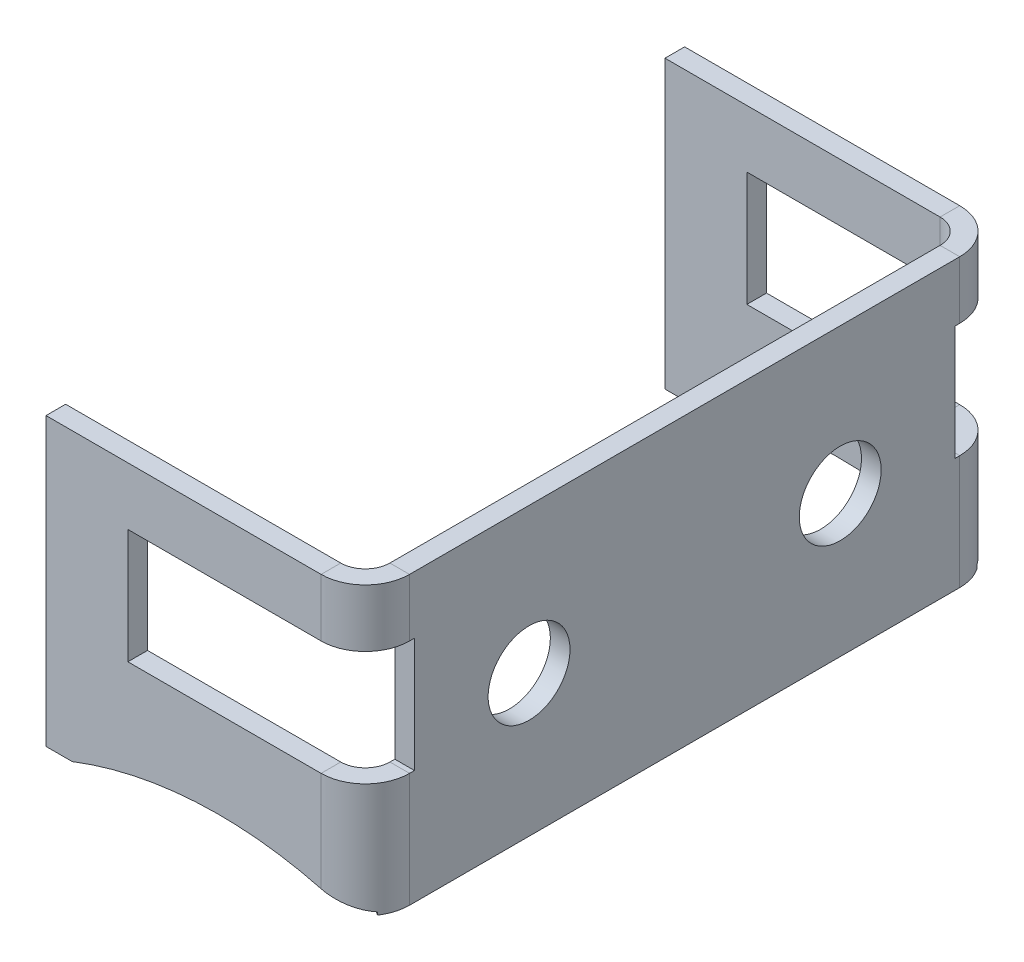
ISO-10303-21;
HEADER;
FILE_DESCRIPTION(('STEP AP214'),'2;1');
FILE_NAME('part.step','',(''),(''),'','','');
FILE_SCHEMA(('AUTOMOTIVE_DESIGN { 1 0 10303 214 1 1 1 1 }'));
ENDSEC;
DATA;
#1=APPLICATION_CONTEXT('core data for automotive mechanical design processes');
#2=APPLICATION_PROTOCOL_DEFINITION('international standard','automotive_design',2000,#1);
#3=PRODUCT_CONTEXT('',#1,'mechanical');
#4=PRODUCT('Part','Part','',(#3));
#5=PRODUCT_RELATED_PRODUCT_CATEGORY('part','',(#4));
#6=PRODUCT_DEFINITION_FORMATION('','',#4);
#7=PRODUCT_DEFINITION_CONTEXT('part definition',#1,'design');
#8=PRODUCT_DEFINITION('design','',#6,#7);
#9=PRODUCT_DEFINITION_SHAPE('','',#8);
#10=(LENGTH_UNIT() NAMED_UNIT(*) SI_UNIT(.MILLI.,.METRE.));
#11=(NAMED_UNIT(*) PLANE_ANGLE_UNIT() SI_UNIT($,.RADIAN.));
#12=(NAMED_UNIT(*) SI_UNIT($,.STERADIAN.) SOLID_ANGLE_UNIT());
#13=UNCERTAINTY_MEASURE_WITH_UNIT(LENGTH_MEASURE(1.E-05),#10,'distance_accuracy_value','');
#14=(GEOMETRIC_REPRESENTATION_CONTEXT(3) GLOBAL_UNCERTAINTY_ASSIGNED_CONTEXT((#13)) GLOBAL_UNIT_ASSIGNED_CONTEXT((#10,
#11,#12)) REPRESENTATION_CONTEXT('',''));
#15=CARTESIAN_POINT('',(0.,0.,0.));
#16=DIRECTION('',(0.,0.,1.));
#17=DIRECTION('',(1.,0.,0.));
#18=AXIS2_PLACEMENT_3D('',#15,#16,#17);
#19=CARTESIAN_POINT('',(0.,-1.77222259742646,-16.5));
#20=DIRECTION('',(0.,1.,0.));
#21=DIRECTION('',(-1.,0.,0.));
#22=AXIS2_PLACEMENT_3D('',#19,#20,#21);
#23=PLANE('',#22);
#24=DIRECTION('',(0.,0.,-1.));
#25=VECTOR('',#24,1.);
#26=CARTESIAN_POINT('',(0.,-1.77222259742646,-16.5));
#27=LINE('',#26,#25);
#28=CARTESIAN_POINT('',(0.,-1.77222259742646,-16.5));
#29=VERTEX_POINT('',#28);
#30=CARTESIAN_POINT('',(0.,-1.77222259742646,-16.8));
#31=VERTEX_POINT('',#30);
#32=EDGE_CURVE('E259',#29,#31,#27,.T.);
#33=ORIENTED_EDGE('',*,*,#32,.T.);
#34=DIRECTION('',(-1.,0.,0.));
#35=VECTOR('',#34,1.);
#36=CARTESIAN_POINT('',(0.,-1.77222259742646,-16.8));
#37=LINE('',#36,#35);
#38=CARTESIAN_POINT('',(-1.19999999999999,-1.77222259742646,-16.8));
#39=VERTEX_POINT('',#38);
#40=EDGE_CURVE('E11',#31,#39,#37,.T.);
#41=ORIENTED_EDGE('',*,*,#40,.T.);
#42=DIRECTION('',(0.,0.,1.));
#43=VECTOR('',#42,1.);
#44=CARTESIAN_POINT('',(-1.19999999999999,-1.77222259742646,-19.5));
#45=LINE('',#44,#43);
#46=CARTESIAN_POINT('',(-1.19999999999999,-1.77222259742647,-16.5));
#47=VERTEX_POINT('',#46);
#48=EDGE_CURVE('E262',#39,#47,#45,.T.);
#49=ORIENTED_EDGE('',*,*,#48,.T.);
#50=DIRECTION('',(1.,0.,0.));
#51=VECTOR('',#50,1.);
#52=CARTESIAN_POINT('',(0.,-1.77222259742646,-16.5));
#53=LINE('',#52,#51);
#54=EDGE_CURVE('E61',#47,#29,#53,.T.);
#55=ORIENTED_EDGE('',*,*,#54,.T.);
#56=EDGE_LOOP('',(#33,#41,#49,#55));
#57=FACE_BOUND('',#56,.T.);
#58=ADVANCED_FACE('F38',(#57),#23,.T.);
#59=DIRECTION('',(1.,0.,0.));
#60=VECTOR('',#59,1.);
#61=CARTESIAN_POINT('',(-19.5,-1.77222259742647,-18.3));
#62=LINE('',#61,#60);
#63=CARTESIAN_POINT('',(-14.5,-1.77222259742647,-18.3));
#64=VERTEX_POINT('',#63);
#65=CARTESIAN_POINT('',(-2.69999999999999,-1.77222259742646,-18.3));
#66=VERTEX_POINT('',#65);
#67=EDGE_CURVE('E286',#64,#66,#62,.T.);
#68=ORIENTED_EDGE('',*,*,#67,.T.);
#69=DIRECTION('',(0.,0.,-1.));
#70=VECTOR('',#69,1.);
#71=CARTESIAN_POINT('',(-2.69999999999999,-1.77222259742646,-18.3));
#72=LINE('',#71,#70);
#73=CARTESIAN_POINT('',(-2.69999999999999,-1.77222259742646,-19.5));
#74=VERTEX_POINT('',#73);
#75=EDGE_CURVE('E46',#66,#74,#72,.T.);
#76=ORIENTED_EDGE('',*,*,#75,.T.);
#77=DIRECTION('',(1.,0.,0.));
#78=VECTOR('',#77,1.);
#79=CARTESIAN_POINT('',(0.,-1.77222259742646,-19.5));
#80=LINE('',#79,#78);
#81=CARTESIAN_POINT('',(-14.5,-1.77222259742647,-19.5));
#82=VERTEX_POINT('',#81);
#83=EDGE_CURVE('E655',#82,#74,#80,.T.);
#84=ORIENTED_EDGE('',*,*,#83,.F.);
#85=DIRECTION('',(0.,0.,-1.));
#86=VECTOR('',#85,1.);
#87=CARTESIAN_POINT('',(-14.5,-1.77222259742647,-16.5));
#88=LINE('',#87,#86);
#89=EDGE_CURVE('E276',#64,#82,#88,.T.);
#90=ORIENTED_EDGE('',*,*,#89,.F.);
#91=EDGE_LOOP('',(#68,#76,#84,#90));
#92=FACE_BOUND('',#91,.T.);
#93=ADVANCED_FACE('F537',(#92),#23,.T.);
#94=CARTESIAN_POINT('',(0.,5.22777740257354,-16.5));
#95=DIRECTION('',(0.,-1.,0.));
#96=DIRECTION('',(1.,0.,0.));
#97=AXIS2_PLACEMENT_3D('',#94,#95,#96);
#98=PLANE('',#97);
#99=DIRECTION('',(-1.,0.,0.));
#100=VECTOR('',#99,1.);
#101=CARTESIAN_POINT('',(0.,5.22777740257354,-19.5));
#102=LINE('',#101,#100);
#103=CARTESIAN_POINT('',(-2.69999999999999,5.22777740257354,-19.5));
#104=VERTEX_POINT('',#103);
#105=CARTESIAN_POINT('',(-14.5,5.22777740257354,-19.5));
#106=VERTEX_POINT('',#105);
#107=EDGE_CURVE('E270',#104,#106,#102,.T.);
#108=ORIENTED_EDGE('',*,*,#107,.F.);
#109=DIRECTION('',(0.,0.,1.));
#110=VECTOR('',#109,1.);
#111=CARTESIAN_POINT('',(-2.69999999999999,5.22777740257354,-19.5));
#112=LINE('',#111,#110);
#113=CARTESIAN_POINT('',(-2.69999999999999,5.22777740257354,-18.3));
#114=VERTEX_POINT('',#113);
#115=EDGE_CURVE('E652',#104,#114,#112,.T.);
#116=ORIENTED_EDGE('',*,*,#115,.T.);
#117=DIRECTION('',(-1.,0.,0.));
#118=VECTOR('',#117,1.);
#119=CARTESIAN_POINT('',(-19.5,5.22777740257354,-18.3));
#120=LINE('',#119,#118);
#121=CARTESIAN_POINT('',(-14.5,5.22777740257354,-18.3));
#122=VERTEX_POINT('',#121);
#123=EDGE_CURVE('E294',#114,#122,#120,.T.);
#124=ORIENTED_EDGE('',*,*,#123,.T.);
#125=DIRECTION('',(0.,0.,-1.));
#126=VECTOR('',#125,1.);
#127=CARTESIAN_POINT('',(-14.5,5.22777740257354,-16.5));
#128=LINE('',#127,#126);
#129=EDGE_CURVE('E278',#122,#106,#128,.T.);
#130=ORIENTED_EDGE('',*,*,#129,.T.);
#131=EDGE_LOOP('',(#108,#116,#124,#130));
#132=FACE_BOUND('',#131,.T.);
#133=ADVANCED_FACE('F543',(#132),#98,.T.);
#134=DIRECTION('',(0.,0.,-1.));
#135=VECTOR('',#134,1.);
#136=CARTESIAN_POINT('',(-1.19999999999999,5.22777740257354,-19.5));
#137=LINE('',#136,#135);
#138=CARTESIAN_POINT('',(-1.19999999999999,5.22777740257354,-16.5));
#139=VERTEX_POINT('',#138);
#140=CARTESIAN_POINT('',(-1.19999999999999,5.22777740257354,-16.8));
#141=VERTEX_POINT('',#140);
#142=EDGE_CURVE('E570',#139,#141,#137,.T.);
#143=ORIENTED_EDGE('',*,*,#142,.T.);
#144=DIRECTION('',(1.,0.,0.));
#145=VECTOR('',#144,1.);
#146=CARTESIAN_POINT('',(-1.19999999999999,5.22777740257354,-16.8));
#147=LINE('',#146,#145);
#148=CARTESIAN_POINT('',(0.,5.22777740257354,-16.8));
#149=VERTEX_POINT('',#148);
#150=EDGE_CURVE('E650',#141,#149,#147,.T.);
#151=ORIENTED_EDGE('',*,*,#150,.T.);
#152=DIRECTION('',(0.,0.,-1.));
#153=VECTOR('',#152,1.);
#154=CARTESIAN_POINT('',(0.,5.22777740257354,-16.5));
#155=LINE('',#154,#153);
#156=CARTESIAN_POINT('',(0.,5.22777740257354,-16.5));
#157=VERTEX_POINT('',#156);
#158=EDGE_CURVE('E53',#157,#149,#155,.T.);
#159=ORIENTED_EDGE('',*,*,#158,.F.);
#160=DIRECTION('',(-1.,0.,0.));
#161=VECTOR('',#160,1.);
#162=CARTESIAN_POINT('',(0.,5.22777740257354,-16.5));
#163=LINE('',#162,#161);
#164=EDGE_CURVE('E264',#157,#139,#163,.T.);
#165=ORIENTED_EDGE('',*,*,#164,.T.);
#166=EDGE_LOOP('',(#143,#151,#159,#165));
#167=FACE_BOUND('',#166,.T.);
#168=ADVANCED_FACE('F485',(#167),#98,.T.);
#169=CARTESIAN_POINT('',(-2.69999999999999,8.75,-16.8));
#170=DIRECTION('',(0.,-1.,0.));
#171=DIRECTION('',(0.,0.,-1.));
#172=AXIS2_PLACEMENT_3D('',#169,#170,#171);
#173=CYLINDRICAL_SURFACE('',#172,2.7);
#174=DIRECTION('',(0.,-1.,0.));
#175=VECTOR('',#174,1.);
#176=CARTESIAN_POINT('',(0.,8.75,-16.8));
#177=LINE('',#176,#175);
#178=CARTESIAN_POINT('',(0.,8.75,-16.8));
#179=VERTEX_POINT('',#178);
#180=EDGE_CURVE('E597',#179,#149,#177,.T.);
#181=ORIENTED_EDGE('',*,*,#180,.T.);
#182=CARTESIAN_POINT('',(-2.69999999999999,5.22777740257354,-16.8));
#183=DIRECTION('',(0.,-1.,0.));
#184=DIRECTION('',(1.,0.,0.));
#185=AXIS2_PLACEMENT_3D('',#182,#183,#184);
#186=CIRCLE('',#185,2.7);
#187=EDGE_CURVE('E296',#149,#104,#186,.F.);
#188=ORIENTED_EDGE('',*,*,#187,.T.);
#189=DIRECTION('',(0.,-1.,0.));
#190=VECTOR('',#189,1.);
#191=CARTESIAN_POINT('',(-2.69999999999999,8.75,-19.5));
#192=LINE('',#191,#190);
#193=CARTESIAN_POINT('',(-2.69999999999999,8.75,-19.5));
#194=VERTEX_POINT('',#193);
#195=EDGE_CURVE('E594',#194,#104,#192,.T.);
#196=ORIENTED_EDGE('',*,*,#195,.F.);
#197=CARTESIAN_POINT('',(-2.69999999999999,8.75,-16.8));
#198=DIRECTION('',(0.,1.,0.));
#199=DIRECTION('',(0.,0.,1.));
#200=AXIS2_PLACEMENT_3D('',#197,#198,#199);
#201=CIRCLE('',#200,2.7);
#202=EDGE_CURVE('E808',#194,#179,#201,.F.);
#203=ORIENTED_EDGE('',*,*,#202,.T.);
#204=EDGE_LOOP('',(#181,#188,#196,#203));
#205=FACE_BOUND('',#204,.T.);
#206=ADVANCED_FACE('F482',(#205),#173,.T.);
#207=CARTESIAN_POINT('',(-2.69999999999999,-7.87568785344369,-19.5));
#208=VERTEX_POINT('',#207);
#209=EDGE_CURVE('E593',#74,#208,#192,.T.);
#210=ORIENTED_EDGE('',*,*,#209,.F.);
#211=CARTESIAN_POINT('',(-2.69999999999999,-1.77222259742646,-16.8));
#212=DIRECTION('',(0.,1.,0.));
#213=DIRECTION('',(-1.,0.,0.));
#214=AXIS2_PLACEMENT_3D('',#211,#212,#213);
#215=CIRCLE('',#214,2.7);
#216=EDGE_CURVE('E289',#74,#31,#215,.F.);
#217=ORIENTED_EDGE('',*,*,#216,.T.);
#218=CARTESIAN_POINT('',(0.,-8.75,-16.8));
#219=VERTEX_POINT('',#218);
#220=EDGE_CURVE('E275',#31,#219,#177,.T.);
#221=ORIENTED_EDGE('',*,*,#220,.T.);
#222=CARTESIAN_POINT('',(-2.69999999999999,-8.75,-16.8));
#223=DIRECTION('',(0.,1.,0.));
#224=DIRECTION('',(0.,0.,1.));
#225=AXIS2_PLACEMENT_3D('',#222,#223,#224);
#226=CIRCLE('',#225,2.7);
#227=CARTESIAN_POINT('',(-0.45500556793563,-8.75,-18.3));
#228=VERTEX_POINT('',#227);
#229=EDGE_CURVE('E736',#228,#219,#226,.F.);
#230=ORIENTED_EDGE('',*,*,#229,.F.);
#231=DIRECTION('',(0.,-1.,0.));
#232=VECTOR('',#231,1.);
#233=CARTESIAN_POINT('',(-0.45500556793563,8.75,-18.3));
#234=LINE('',#233,#232);
#235=CARTESIAN_POINT('',(-0.45500556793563,-8.57832905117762,-18.3));
#236=VERTEX_POINT('',#235);
#237=EDGE_CURVE('E357',#228,#236,#234,.F.);
#238=ORIENTED_EDGE('',*,*,#237,.T.);
#239=CARTESIAN_POINT('',(-0.45500556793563,-8.57832905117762,-18.3));
#240=CARTESIAN_POINT('',(-0.497598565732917,-8.56274688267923,-18.3637454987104));
#241=CARTESIAN_POINT('',(-0.542787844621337,-8.54634122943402,-18.4255003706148));
#242=CARTESIAN_POINT('',(-0.638006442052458,-8.51211339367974,-18.5447078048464));
#243=CARTESIAN_POINT('',(-0.688034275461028,-8.49429164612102,-18.6021616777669));
#244=CARTESIAN_POINT('',(-0.844609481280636,-8.43913094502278,-18.7673526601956));
#245=CARTESIAN_POINT('',(-0.957879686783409,-8.40001090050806,-18.8682626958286));
#246=CARTESIAN_POINT('',(-1.20001122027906,-8.31863524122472,-19.050154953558));
#247=CARTESIAN_POINT('',(-1.32900269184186,-8.27635475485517,-19.1309512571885));
#248=CARTESIAN_POINT('',(-1.59844102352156,-8.19070637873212,-19.2697221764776));
#249=CARTESIAN_POINT('',(-1.73889027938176,-8.1473382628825,-19.3276920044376));
#250=CARTESIAN_POINT('',(-2.01481730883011,-8.06499013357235,-19.415255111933));
#251=CARTESIAN_POINT('',(-2.14962403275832,-8.02596326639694,-19.4469156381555));
#252=CARTESIAN_POINT('',(-2.35448730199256,-7.96858878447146,-19.4786954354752));
#253=CARTESIAN_POINT('',(-2.4232364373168,-7.94965323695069,-19.4866702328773));
#254=CARTESIAN_POINT('',(-2.56128827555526,-7.91227460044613,-19.4973227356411));
#255=CARTESIAN_POINT('',(-2.63059106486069,-7.89383159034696,-19.4999995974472));
#256=CARTESIAN_POINT('',(-2.69999999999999,-7.87568785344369,-19.5));
#257=B_SPLINE_CURVE_WITH_KNOTS('',3,(#239,#240,#241,#242,#243,#244,#245,#246,#247,#248,#249,
#250,#251,#252,#253,#254,#255,#256),.UNSPECIFIED.,.F.,.F.,(4,2,2,2,2,2,2,2,4),(0.,
0.234544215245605,0.469016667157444,0.936709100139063,1.40857621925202,1.88054225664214,
2.31047945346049,2.52556583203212,2.74068645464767),.UNSPECIFIED.);
#258=EDGE_CURVE('E363',#236,#208,#257,.T.);
#259=ORIENTED_EDGE('',*,*,#258,.T.);
#260=EDGE_LOOP('',(#210,#217,#221,#230,#238,#259));
#261=FACE_BOUND('',#260,.T.);
#262=ADVANCED_FACE('F480',(#261),#173,.T.);
#263=CARTESIAN_POINT('',(-19.5,8.75,-19.5));
#264=DIRECTION('',(0.,0.,-1.));
#265=DIRECTION('',(-1.,0.,0.));
#266=AXIS2_PLACEMENT_3D('',#263,#264,#265);
#267=PLANE('',#266);
#268=ORIENTED_EDGE('',*,*,#195,.T.);
#269=ORIENTED_EDGE('',*,*,#107,.T.);
#270=DIRECTION('',(0.,-1.,0.));
#271=VECTOR('',#270,1.);
#272=CARTESIAN_POINT('',(-14.5,5.22777740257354,-19.5));
#273=LINE('',#272,#271);
#274=EDGE_CURVE('E834',#106,#82,#273,.T.);
#275=ORIENTED_EDGE('',*,*,#274,.T.);
#276=ORIENTED_EDGE('',*,*,#83,.T.);
#277=ORIENTED_EDGE('',*,*,#209,.T.);
#278=CARTESIAN_POINT('',(-8.94999999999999,-31.7827225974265,-19.5));
#279=DIRECTION('',(0.,0.,1.));
#280=DIRECTION('',(1.,0.,0.));
#281=AXIS2_PLACEMENT_3D('',#278,#279,#280);
#282=CIRCLE('',#281,24.7105);
#283=CARTESIAN_POINT('',(-17.9,-8.75,-19.5));
#284=VERTEX_POINT('',#283);
#285=EDGE_CURVE('E371',#208,#284,#282,.T.);
#286=ORIENTED_EDGE('',*,*,#285,.T.);
#287=DIRECTION('',(1.,0.,0.));
#288=VECTOR('',#287,1.);
#289=CARTESIAN_POINT('',(-19.5,-8.75,-19.5));
#290=LINE('',#289,#288);
#291=CARTESIAN_POINT('',(-19.5,-8.75,-19.5));
#292=VERTEX_POINT('',#291);
#293=EDGE_CURVE('E739',#292,#284,#290,.T.);
#294=ORIENTED_EDGE('',*,*,#293,.F.);
#295=DIRECTION('',(0.,-1.,0.));
#296=VECTOR('',#295,1.);
#297=CARTESIAN_POINT('',(-19.5,8.75,-19.5));
#298=LINE('',#297,#296);
#299=CARTESIAN_POINT('',(-19.5,8.75,-19.5));
#300=VERTEX_POINT('',#299);
#301=EDGE_CURVE('E591',#300,#292,#298,.T.);
#302=ORIENTED_EDGE('',*,*,#301,.F.);
#303=DIRECTION('',(1.,0.,0.));
#304=VECTOR('',#303,1.);
#305=CARTESIAN_POINT('',(-19.5,8.75,-19.5));
#306=LINE('',#305,#304);
#307=EDGE_CURVE('E815',#300,#194,#306,.T.);
#308=ORIENTED_EDGE('',*,*,#307,.T.);
#309=EDGE_LOOP('',(#268,#269,#275,#276,#277,#286,#294,#302,#308));
#310=FACE_BOUND('',#309,.T.);
#311=ADVANCED_FACE('F472',(#310),#267,.T.);
#312=CARTESIAN_POINT('',(-19.5,8.75,-18.3));
#313=DIRECTION('',(0.,0.,-1.));
#314=DIRECTION('',(-1.,0.,0.));
#315=AXIS2_PLACEMENT_3D('',#312,#313,#314);
#316=PLANE('',#315);
#317=ORIENTED_EDGE('',*,*,#123,.F.);
#318=DIRECTION('',(0.,-1.,0.));
#319=VECTOR('',#318,1.);
#320=CARTESIAN_POINT('',(-2.69999999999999,8.75,-18.3));
#321=LINE('',#320,#319);
#322=CARTESIAN_POINT('',(-2.69999999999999,8.75,-18.3));
#323=VERTEX_POINT('',#322);
#324=EDGE_CURVE('E586',#323,#114,#321,.T.);
#325=ORIENTED_EDGE('',*,*,#324,.F.);
#326=DIRECTION('',(1.,0.,0.));
#327=VECTOR('',#326,1.);
#328=CARTESIAN_POINT('',(-19.5,8.75,-18.3));
#329=LINE('',#328,#327);
#330=CARTESIAN_POINT('',(-19.5,8.75,-18.3));
#331=VERTEX_POINT('',#330);
#332=EDGE_CURVE('E818',#331,#323,#329,.T.);
#333=ORIENTED_EDGE('',*,*,#332,.F.);
#334=DIRECTION('',(0.,-1.,0.));
#335=VECTOR('',#334,1.);
#336=CARTESIAN_POINT('',(-19.5,8.75,-18.3));
#337=LINE('',#336,#335);
#338=CARTESIAN_POINT('',(-19.5,-8.75,-18.3));
#339=VERTEX_POINT('',#338);
#340=EDGE_CURVE('E589',#331,#339,#337,.T.);
#341=ORIENTED_EDGE('',*,*,#340,.T.);
#342=DIRECTION('',(1.,0.,0.));
#343=VECTOR('',#342,1.);
#344=CARTESIAN_POINT('',(-19.5,-8.75,-18.3));
#345=LINE('',#344,#343);
#346=CARTESIAN_POINT('',(-17.9,-8.75,-18.3));
#347=VERTEX_POINT('',#346);
#348=EDGE_CURVE('E745',#339,#347,#345,.T.);
#349=ORIENTED_EDGE('',*,*,#348,.T.);
#350=CARTESIAN_POINT('',(-8.94999999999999,-31.7827225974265,-18.3));
#351=DIRECTION('',(0.,0.,1.));
#352=DIRECTION('',(1.,0.,0.));
#353=AXIS2_PLACEMENT_3D('',#350,#351,#352);
#354=CIRCLE('',#353,24.7105);
#355=CARTESIAN_POINT('',(-2.69999999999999,-7.87568785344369,-18.3));
#356=VERTEX_POINT('',#355);
#357=EDGE_CURVE('E662',#356,#347,#354,.T.);
#358=ORIENTED_EDGE('',*,*,#357,.F.);
#359=EDGE_CURVE('E580',#66,#356,#321,.T.);
#360=ORIENTED_EDGE('',*,*,#359,.F.);
#361=ORIENTED_EDGE('',*,*,#67,.F.);
#362=DIRECTION('',(0.,-1.,0.));
#363=VECTOR('',#362,1.);
#364=CARTESIAN_POINT('',(-14.5,8.75,-18.3));
#365=LINE('',#364,#363);
#366=EDGE_CURVE('E648',#122,#64,#365,.T.);
#367=ORIENTED_EDGE('',*,*,#366,.F.);
#368=EDGE_LOOP('',(#317,#325,#333,#341,#349,#358,#360,#361,#367));
#369=FACE_BOUND('',#368,.T.);
#370=ADVANCED_FACE('F468',(#369),#316,.F.);
#371=CARTESIAN_POINT('',(-2.69999999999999,8.75,-16.8));
#372=DIRECTION('',(0.,-1.,0.));
#373=DIRECTION('',(0.,0.,-1.));
#374=AXIS2_PLACEMENT_3D('',#371,#372,#373);
#375=CYLINDRICAL_SURFACE('',#374,1.5);
#376=CARTESIAN_POINT('',(-2.69999999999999,5.22777740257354,-16.8));
#377=DIRECTION('',(0.,-1.,0.));
#378=DIRECTION('',(1.,0.,0.));
#379=AXIS2_PLACEMENT_3D('',#376,#377,#378);
#380=CIRCLE('',#379,1.5);
#381=EDGE_CURVE('E291',#141,#114,#380,.F.);
#382=ORIENTED_EDGE('',*,*,#381,.F.);
#383=DIRECTION('',(0.,-1.,0.));
#384=VECTOR('',#383,1.);
#385=CARTESIAN_POINT('',(-1.19999999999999,8.75,-16.8));
#386=LINE('',#385,#384);
#387=CARTESIAN_POINT('',(-1.19999999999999,8.75,-16.8));
#388=VERTEX_POINT('',#387);
#389=EDGE_CURVE('E576',#388,#141,#386,.T.);
#390=ORIENTED_EDGE('',*,*,#389,.F.);
#391=CARTESIAN_POINT('',(-2.69999999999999,8.75,-16.8));
#392=DIRECTION('',(0.,1.,0.));
#393=DIRECTION('',(1.,0.,0.));
#394=AXIS2_PLACEMENT_3D('',#391,#392,#393);
#395=CIRCLE('',#394,1.5);
#396=EDGE_CURVE('E719',#323,#388,#395,.F.);
#397=ORIENTED_EDGE('',*,*,#396,.F.);
#398=ORIENTED_EDGE('',*,*,#324,.T.);
#399=EDGE_LOOP('',(#382,#390,#397,#398));
#400=FACE_BOUND('',#399,.T.);
#401=ADVANCED_FACE('F464',(#400),#375,.F.);
#402=CARTESIAN_POINT('',(-2.69999999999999,-1.77222259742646,-16.8));
#403=DIRECTION('',(0.,1.,0.));
#404=DIRECTION('',(-1.,0.,0.));
#405=AXIS2_PLACEMENT_3D('',#402,#403,#404);
#406=CIRCLE('',#405,1.5);
#407=EDGE_CURVE('E283',#66,#39,#406,.F.);
#408=ORIENTED_EDGE('',*,*,#407,.F.);
#409=ORIENTED_EDGE('',*,*,#359,.T.);
#410=CARTESIAN_POINT('',(-1.45278087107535,-8.57832905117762,-17.6333333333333));
#411=CARTESIAN_POINT('',(-1.47963955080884,-8.56064460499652,-17.6735233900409));
#412=CARTESIAN_POINT('',(-1.50820729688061,-8.54199571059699,-17.7120816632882));
#413=CARTESIAN_POINT('',(-1.56842194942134,-8.50312810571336,-17.7857982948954));
#414=CARTESIAN_POINT('',(-1.60006616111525,-8.48291077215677,-17.8209595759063));
#415=CARTESIAN_POINT('',(-1.69892299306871,-8.42055734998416,-17.9209835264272));
#416=CARTESIAN_POINT('',(-1.77027407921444,-8.37657666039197,-17.9807009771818));
#417=CARTESIAN_POINT('',(-1.91636021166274,-8.28925561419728,-18.0819022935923));
#418=CARTESIAN_POINT('',(-1.99053647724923,-8.24607456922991,-18.1243489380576));
#419=CARTESIAN_POINT('',(-2.14474821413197,-8.15910598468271,-18.1960361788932));
#420=CARTESIAN_POINT('',(-2.22478483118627,-8.11531832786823,-18.2252741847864));
#421=CARTESIAN_POINT('',(-2.37051023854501,-8.03834971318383,-18.2648496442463));
#422=CARTESIAN_POINT('',(-2.43537101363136,-8.00500085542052,-18.2779607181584));
#423=CARTESIAN_POINT('',(-2.56667864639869,-7.9393994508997,-18.2955280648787));
#424=CARTESIAN_POINT('',(-2.63312319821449,-7.90714545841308,-18.299996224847));
#425=CARTESIAN_POINT('',(-2.69999999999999,-7.87568785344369,-18.3));
#426=B_SPLINE_CURVE_WITH_KNOTS('',3,(#410,#411,#412,#413,#414,#415,#416,#417,#418,#419,#420,
#421,#422,#423,#424,#425),.UNSPECIFIED.,.F.,.F.,(4,2,2,2,2,2,2,4),(0.,0.154265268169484,
0.308396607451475,0.615457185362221,0.901667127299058,1.18793317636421,1.40973098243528,
1.63122351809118),.UNSPECIFIED.);
#427=CARTESIAN_POINT('',(-1.45278087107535,-8.57832905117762,-17.6333333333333));
#428=VERTEX_POINT('',#427);
#429=EDGE_CURVE('E362',#428,#356,#426,.T.);
#430=ORIENTED_EDGE('',*,*,#429,.F.);
#431=DIRECTION('',(0.,-1.,0.));
#432=VECTOR('',#431,1.);
#433=CARTESIAN_POINT('',(-1.45278087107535,8.75,-17.6333333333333));
#434=LINE('',#433,#432);
#435=CARTESIAN_POINT('',(-1.45278087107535,-8.75,-17.6333333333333));
#436=VERTEX_POINT('',#435);
#437=EDGE_CURVE('E360',#436,#428,#434,.F.);
#438=ORIENTED_EDGE('',*,*,#437,.F.);
#439=CARTESIAN_POINT('',(-2.69999999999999,-8.75,-16.8));
#440=DIRECTION('',(0.,1.,0.));
#441=DIRECTION('',(1.,0.,0.));
#442=AXIS2_PLACEMENT_3D('',#439,#440,#441);
#443=CIRCLE('',#442,1.5);
#444=CARTESIAN_POINT('',(-1.19999999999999,-8.75,-16.8));
#445=VERTEX_POINT('',#444);
#446=EDGE_CURVE('E574',#436,#445,#443,.F.);
#447=ORIENTED_EDGE('',*,*,#446,.T.);
#448=EDGE_CURVE('E567',#39,#445,#386,.T.);
#449=ORIENTED_EDGE('',*,*,#448,.F.);
#450=EDGE_LOOP('',(#408,#409,#430,#438,#447,#449));
#451=FACE_BOUND('',#450,.T.);
#452=ADVANCED_FACE('F467',(#451),#375,.F.);
#453=CARTESIAN_POINT('',(0.,8.75,-19.5));
#454=DIRECTION('',(1.,0.,0.));
#455=DIRECTION('',(0.,0.,-1.));
#456=AXIS2_PLACEMENT_3D('',#453,#454,#455);
#457=PLANE('',#456);
#458=CARTESIAN_POINT('',(0.,-0.117157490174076,9.5));
#459=DIRECTION('',(1.,0.,0.));
#460=DIRECTION('',(0.,0.,-1.));
#461=AXIS2_PLACEMENT_3D('',#458,#459,#460);
#462=CIRCLE('',#461,2.5);
#463=CARTESIAN_POINT('',(0.,-0.117157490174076,7.));
#464=VERTEX_POINT('',#463);
#465=EDGE_CURVE('E351',#464,#464,#462,.T.);
#466=ORIENTED_EDGE('',*,*,#465,.F.);
#467=EDGE_LOOP('',(#466));
#468=FACE_BOUND('',#467,.T.);
#469=CARTESIAN_POINT('',(0.,-0.117157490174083,-9.5));
#470=DIRECTION('',(1.,0.,0.));
#471=DIRECTION('',(0.,0.,-1.));
#472=AXIS2_PLACEMENT_3D('',#469,#470,#471);
#473=CIRCLE('',#472,2.5);
#474=CARTESIAN_POINT('',(0.,-0.117157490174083,-12.));
#475=VERTEX_POINT('',#474);
#476=EDGE_CURVE('E347',#475,#475,#473,.T.);
#477=ORIENTED_EDGE('',*,*,#476,.F.);
#478=EDGE_LOOP('',(#477));
#479=FACE_BOUND('',#478,.T.);
#480=DIRECTION('',(0.,1.,0.));
#481=VECTOR('',#480,1.);
#482=CARTESIAN_POINT('',(0.,5.22777740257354,-16.5));
#483=LINE('',#482,#481);
#484=EDGE_CURVE('E265',#29,#157,#483,.T.);
#485=ORIENTED_EDGE('',*,*,#484,.T.);
#486=ORIENTED_EDGE('',*,*,#158,.T.);
#487=ORIENTED_EDGE('',*,*,#180,.F.);
#488=DIRECTION('',(0.,0.,1.));
#489=VECTOR('',#488,1.);
#490=CARTESIAN_POINT('',(0.,8.75,-19.5));
#491=LINE('',#490,#489);
#492=CARTESIAN_POINT('',(0.,8.75,16.8));
#493=VERTEX_POINT('',#492);
#494=EDGE_CURVE('E806',#179,#493,#491,.T.);
#495=ORIENTED_EDGE('',*,*,#494,.T.);
#496=DIRECTION('',(0.,-1.,0.));
#497=VECTOR('',#496,1.);
#498=CARTESIAN_POINT('',(0.,8.75,16.8));
#499=LINE('',#498,#497);
#500=CARTESIAN_POINT('',(0.,5.22777740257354,16.8));
#501=VERTEX_POINT('',#500);
#502=EDGE_CURVE('E601',#493,#501,#499,.T.);
#503=ORIENTED_EDGE('',*,*,#502,.T.);
#504=DIRECTION('',(0.,0.,1.));
#505=VECTOR('',#504,1.);
#506=CARTESIAN_POINT('',(0.,5.22777740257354,16.5));
#507=LINE('',#506,#505);
#508=CARTESIAN_POINT('',(0.,5.22777740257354,16.5));
#509=VERTEX_POINT('',#508);
#510=EDGE_CURVE('E309',#509,#501,#507,.T.);
#511=ORIENTED_EDGE('',*,*,#510,.F.);
#512=DIRECTION('',(0.,1.,0.));
#513=VECTOR('',#512,1.);
#514=CARTESIAN_POINT('',(0.,5.22777740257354,16.5));
#515=LINE('',#514,#513);
#516=CARTESIAN_POINT('',(0.,-1.77222259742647,16.5));
#517=VERTEX_POINT('',#516);
#518=EDGE_CURVE('E300',#517,#509,#515,.T.);
#519=ORIENTED_EDGE('',*,*,#518,.F.);
#520=DIRECTION('',(0.,0.,1.));
#521=VECTOR('',#520,1.);
#522=CARTESIAN_POINT('',(0.,-1.77222259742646,16.5));
#523=LINE('',#522,#521);
#524=CARTESIAN_POINT('',(0.,-1.77222259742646,16.8));
#525=VERTEX_POINT('',#524);
#526=EDGE_CURVE('E317',#517,#525,#523,.T.);
#527=ORIENTED_EDGE('',*,*,#526,.T.);
#528=CARTESIAN_POINT('',(0.,-8.75,16.8));
#529=VERTEX_POINT('',#528);
#530=EDGE_CURVE('E600',#525,#529,#499,.T.);
#531=ORIENTED_EDGE('',*,*,#530,.T.);
#532=DIRECTION('',(0.,0.,1.));
#533=VECTOR('',#532,1.);
#534=CARTESIAN_POINT('',(0.,-8.75,-19.5));
#535=LINE('',#534,#533);
#536=EDGE_CURVE('E733',#219,#529,#535,.T.);
#537=ORIENTED_EDGE('',*,*,#536,.F.);
#538=ORIENTED_EDGE('',*,*,#220,.F.);
#539=ORIENTED_EDGE('',*,*,#32,.F.);
#540=EDGE_LOOP('',(#485,#486,#487,#495,#503,#511,#519,#527,#531,#537,#538,#539));
#541=FACE_BOUND('',#540,.T.);
#542=ADVANCED_FACE('F273',(#468,#479,#541),#457,.T.);
#543=CARTESIAN_POINT('',(-1.19999999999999,8.75,-19.5));
#544=DIRECTION('',(1.,0.,0.));
#545=DIRECTION('',(0.,0.,-1.));
#546=AXIS2_PLACEMENT_3D('',#543,#544,#545);
#547=PLANE('',#546);
#548=CARTESIAN_POINT('',(-1.2,-0.117157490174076,9.5));
#549=DIRECTION('',(1.,0.,0.));
#550=DIRECTION('',(0.,0.,-1.));
#551=AXIS2_PLACEMENT_3D('',#548,#549,#550);
#552=CIRCLE('',#551,2.5);
#553=CARTESIAN_POINT('',(-1.2,-0.117157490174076,7.));
#554=VERTEX_POINT('',#553);
#555=EDGE_CURVE('E354',#554,#554,#552,.T.);
#556=ORIENTED_EDGE('',*,*,#555,.T.);
#557=EDGE_LOOP('',(#556));
#558=FACE_BOUND('',#557,.T.);
#559=CARTESIAN_POINT('',(-1.2,-0.117157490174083,-9.5));
#560=DIRECTION('',(1.,0.,0.));
#561=DIRECTION('',(0.,0.,-1.));
#562=AXIS2_PLACEMENT_3D('',#559,#560,#561);
#563=CIRCLE('',#562,2.5);
#564=CARTESIAN_POINT('',(-1.2,-0.117157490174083,-12.));
#565=VERTEX_POINT('',#564);
#566=EDGE_CURVE('E348',#565,#565,#563,.T.);
#567=ORIENTED_EDGE('',*,*,#566,.T.);
#568=EDGE_LOOP('',(#567));
#569=FACE_BOUND('',#568,.T.);
#570=ORIENTED_EDGE('',*,*,#142,.F.);
#571=DIRECTION('',(0.,-1.,0.));
#572=VECTOR('',#571,1.);
#573=CARTESIAN_POINT('',(-1.19999999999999,8.75,-16.5));
#574=LINE('',#573,#572);
#575=EDGE_CURVE('E569',#139,#47,#574,.T.);
#576=ORIENTED_EDGE('',*,*,#575,.T.);
#577=ORIENTED_EDGE('',*,*,#48,.F.);
#578=ORIENTED_EDGE('',*,*,#448,.T.);
#579=DIRECTION('',(0.,0.,1.));
#580=VECTOR('',#579,1.);
#581=CARTESIAN_POINT('',(-1.19999999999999,-8.75,-19.5));
#582=LINE('',#581,#580);
#583=CARTESIAN_POINT('',(-1.19999999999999,-8.75,16.8));
#584=VERTEX_POINT('',#583);
#585=EDGE_CURVE('E701',#445,#584,#582,.T.);
#586=ORIENTED_EDGE('',*,*,#585,.T.);
#587=DIRECTION('',(0.,-1.,0.));
#588=VECTOR('',#587,1.);
#589=CARTESIAN_POINT('',(-1.19999999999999,8.75,16.8));
#590=LINE('',#589,#588);
#591=CARTESIAN_POINT('',(-1.19999999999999,-1.77222259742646,16.8));
#592=VERTEX_POINT('',#591);
#593=EDGE_CURVE('E582',#592,#584,#590,.T.);
#594=ORIENTED_EDGE('',*,*,#593,.F.);
#595=DIRECTION('',(0.,0.,-1.));
#596=VECTOR('',#595,1.);
#597=CARTESIAN_POINT('',(-1.19999999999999,-1.77222259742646,-19.5));
#598=LINE('',#597,#596);
#599=CARTESIAN_POINT('',(-1.19999999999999,-1.77222259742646,16.5));
#600=VERTEX_POINT('',#599);
#601=EDGE_CURVE('E634',#592,#600,#598,.T.);
#602=ORIENTED_EDGE('',*,*,#601,.T.);
#603=DIRECTION('',(0.,1.,0.));
#604=VECTOR('',#603,1.);
#605=CARTESIAN_POINT('',(-1.19999999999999,8.75,16.5));
#606=LINE('',#605,#604);
#607=CARTESIAN_POINT('',(-1.19999999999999,5.22777740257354,16.5));
#608=VERTEX_POINT('',#607);
#609=EDGE_CURVE('E628',#600,#608,#606,.T.);
#610=ORIENTED_EDGE('',*,*,#609,.T.);
#611=DIRECTION('',(0.,0.,1.));
#612=VECTOR('',#611,1.);
#613=CARTESIAN_POINT('',(-1.19999999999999,5.22777740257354,-19.5));
#614=LINE('',#613,#612);
#615=CARTESIAN_POINT('',(-1.19999999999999,5.22777740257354,16.8));
#616=VERTEX_POINT('',#615);
#617=EDGE_CURVE('E631',#608,#616,#614,.T.);
#618=ORIENTED_EDGE('',*,*,#617,.T.);
#619=CARTESIAN_POINT('',(-1.19999999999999,8.75,16.8));
#620=VERTEX_POINT('',#619);
#621=EDGE_CURVE('E577',#620,#616,#590,.T.);
#622=ORIENTED_EDGE('',*,*,#621,.F.);
#623=DIRECTION('',(0.,0.,1.));
#624=VECTOR('',#623,1.);
#625=CARTESIAN_POINT('',(-1.19999999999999,8.75,-19.5));
#626=LINE('',#625,#624);
#627=EDGE_CURVE('E715',#388,#620,#626,.T.);
#628=ORIENTED_EDGE('',*,*,#627,.F.);
#629=ORIENTED_EDGE('',*,*,#389,.T.);
#630=EDGE_LOOP('',(#570,#576,#577,#578,#586,#594,#602,#610,#618,#622,#628,#629));
#631=FACE_BOUND('',#630,.T.);
#632=ADVANCED_FACE('F459',(#558,#569,#631),#547,.F.);
#633=CARTESIAN_POINT('',(0.,5.22777740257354,16.5));
#634=DIRECTION('',(0.,1.,0.));
#635=DIRECTION('',(-1.,0.,0.));
#636=AXIS2_PLACEMENT_3D('',#633,#634,#635);
#637=PLANE('',#636);
#638=DIRECTION('',(-1.,0.,0.));
#639=VECTOR('',#638,1.);
#640=CARTESIAN_POINT('',(0.,5.22777740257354,18.3));
#641=LINE('',#640,#639);
#642=CARTESIAN_POINT('',(-2.69999999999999,5.22777740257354,18.3));
#643=VERTEX_POINT('',#642);
#644=CARTESIAN_POINT('',(-14.5,5.22777740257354,18.3));
#645=VERTEX_POINT('',#644);
#646=EDGE_CURVE('E329',#643,#645,#641,.T.);
#647=ORIENTED_EDGE('',*,*,#646,.F.);
#648=DIRECTION('',(0.,0.,1.));
#649=VECTOR('',#648,1.);
#650=CARTESIAN_POINT('',(-2.69999999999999,5.22777740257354,18.3));
#651=LINE('',#650,#649);
#652=CARTESIAN_POINT('',(-2.69999999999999,5.22777740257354,19.5));
#653=VERTEX_POINT('',#652);
#654=EDGE_CURVE('E643',#643,#653,#651,.T.);
#655=ORIENTED_EDGE('',*,*,#654,.T.);
#656=DIRECTION('',(-1.,0.,0.));
#657=VECTOR('',#656,1.);
#658=CARTESIAN_POINT('',(0.,5.22777740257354,19.5));
#659=LINE('',#658,#657);
#660=CARTESIAN_POINT('',(-14.5,5.22777740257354,19.5));
#661=VERTEX_POINT('',#660);
#662=EDGE_CURVE('E299',#653,#661,#659,.T.);
#663=ORIENTED_EDGE('',*,*,#662,.T.);
#664=DIRECTION('',(0.,0.,1.));
#665=VECTOR('',#664,1.);
#666=CARTESIAN_POINT('',(-14.5,5.22777740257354,16.5));
#667=LINE('',#666,#665);
#668=EDGE_CURVE('E323',#645,#661,#667,.T.);
#669=ORIENTED_EDGE('',*,*,#668,.F.);
#670=EDGE_LOOP('',(#647,#655,#663,#669));
#671=FACE_BOUND('',#670,.T.);
#672=ADVANCED_FACE('F462',(#671),#637,.F.);
#673=ORIENTED_EDGE('',*,*,#510,.T.);
#674=DIRECTION('',(-1.,0.,0.));
#675=VECTOR('',#674,1.);
#676=CARTESIAN_POINT('',(0.,5.22777740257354,16.8));
#677=LINE('',#676,#675);
#678=EDGE_CURVE('E641',#501,#616,#677,.T.);
#679=ORIENTED_EDGE('',*,*,#678,.T.);
#680=ORIENTED_EDGE('',*,*,#617,.F.);
#681=DIRECTION('',(-1.,0.,0.));
#682=VECTOR('',#681,1.);
#683=CARTESIAN_POINT('',(0.,5.22777740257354,16.5));
#684=LINE('',#683,#682);
#685=EDGE_CURVE('E303',#509,#608,#684,.T.);
#686=ORIENTED_EDGE('',*,*,#685,.F.);
#687=EDGE_LOOP('',(#673,#679,#680,#686));
#688=FACE_BOUND('',#687,.T.);
#689=ADVANCED_FACE('F789',(#688),#637,.F.);
#690=CARTESIAN_POINT('',(0.,-1.77222259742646,16.5));
#691=DIRECTION('',(0.,-1.,0.));
#692=DIRECTION('',(1.,0.,0.));
#693=AXIS2_PLACEMENT_3D('',#690,#691,#692);
#694=PLANE('',#693);
#695=ORIENTED_EDGE('',*,*,#601,.F.);
#696=DIRECTION('',(1.,0.,0.));
#697=VECTOR('',#696,1.);
#698=CARTESIAN_POINT('',(-1.19999999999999,-1.77222259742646,16.8));
#699=LINE('',#698,#697);
#700=EDGE_CURVE('E639',#592,#525,#699,.T.);
#701=ORIENTED_EDGE('',*,*,#700,.T.);
#702=ORIENTED_EDGE('',*,*,#526,.F.);
#703=DIRECTION('',(1.,0.,0.));
#704=VECTOR('',#703,1.);
#705=CARTESIAN_POINT('',(0.,-1.77222259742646,16.5));
#706=LINE('',#705,#704);
#707=EDGE_CURVE('E306',#600,#517,#706,.T.);
#708=ORIENTED_EDGE('',*,*,#707,.F.);
#709=EDGE_LOOP('',(#695,#701,#702,#708));
#710=FACE_BOUND('',#709,.T.);
#711=ADVANCED_FACE('F764',(#710),#694,.F.);
#712=DIRECTION('',(1.,0.,0.));
#713=VECTOR('',#712,1.);
#714=CARTESIAN_POINT('',(0.,-1.77222259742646,19.5));
#715=LINE('',#714,#713);
#716=CARTESIAN_POINT('',(-14.5,-1.77222259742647,19.5));
#717=VERTEX_POINT('',#716);
#718=CARTESIAN_POINT('',(-2.69999999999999,-1.77222259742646,19.5));
#719=VERTEX_POINT('',#718);
#720=EDGE_CURVE('E304',#717,#719,#715,.T.);
#721=ORIENTED_EDGE('',*,*,#720,.T.);
#722=DIRECTION('',(0.,0.,-1.));
#723=VECTOR('',#722,1.);
#724=CARTESIAN_POINT('',(-2.69999999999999,-1.77222259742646,19.5));
#725=LINE('',#724,#723);
#726=CARTESIAN_POINT('',(-2.69999999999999,-1.77222259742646,18.3));
#727=VERTEX_POINT('',#726);
#728=EDGE_CURVE('E637',#719,#727,#725,.T.);
#729=ORIENTED_EDGE('',*,*,#728,.T.);
#730=DIRECTION('',(1.,0.,0.));
#731=VECTOR('',#730,1.);
#732=CARTESIAN_POINT('',(0.,-1.77222259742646,18.3));
#733=LINE('',#732,#731);
#734=CARTESIAN_POINT('',(-14.5,-1.77222259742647,18.3));
#735=VERTEX_POINT('',#734);
#736=EDGE_CURVE('E338',#735,#727,#733,.T.);
#737=ORIENTED_EDGE('',*,*,#736,.F.);
#738=DIRECTION('',(0.,0.,1.));
#739=VECTOR('',#738,1.);
#740=CARTESIAN_POINT('',(-14.5,-1.77222259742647,16.5));
#741=LINE('',#740,#739);
#742=EDGE_CURVE('E321',#735,#717,#741,.T.);
#743=ORIENTED_EDGE('',*,*,#742,.T.);
#744=EDGE_LOOP('',(#721,#729,#737,#743));
#745=FACE_BOUND('',#744,.T.);
#746=ADVANCED_FACE('F770',(#745),#694,.F.);
#747=CARTESIAN_POINT('',(-2.69999999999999,8.75,16.8));
#748=DIRECTION('',(0.,-1.,0.));
#749=DIRECTION('',(0.,0.,-1.));
#750=AXIS2_PLACEMENT_3D('',#747,#748,#749);
#751=CYLINDRICAL_SURFACE('',#750,2.7);
#752=CARTESIAN_POINT('',(-2.69999999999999,-1.77222259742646,16.8));
#753=DIRECTION('',(0.,-1.,0.));
#754=DIRECTION('',(1.,0.,0.));
#755=AXIS2_PLACEMENT_3D('',#752,#753,#754);
#756=CIRCLE('',#755,2.7);
#757=EDGE_CURVE('E341',#719,#525,#756,.F.);
#758=ORIENTED_EDGE('',*,*,#757,.F.);
#759=DIRECTION('',(0.,-1.,0.));
#760=VECTOR('',#759,1.);
#761=CARTESIAN_POINT('',(-2.69999999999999,8.75,19.5));
#762=LINE('',#761,#760);
#763=CARTESIAN_POINT('',(-2.69999999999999,-7.87568785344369,19.5));
#764=VERTEX_POINT('',#763);
#765=EDGE_CURVE('E604',#719,#764,#762,.T.);
#766=ORIENTED_EDGE('',*,*,#765,.T.);
#767=CARTESIAN_POINT('',(-0.455005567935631,-8.57832905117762,18.3));
#768=CARTESIAN_POINT('',(-0.497598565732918,-8.56274688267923,18.3637454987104));
#769=CARTESIAN_POINT('',(-0.542787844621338,-8.54634122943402,18.4255003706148));
#770=CARTESIAN_POINT('',(-0.638006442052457,-8.51211339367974,18.5447078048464));
#771=CARTESIAN_POINT('',(-0.688034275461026,-8.49429164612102,18.6021616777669));
#772=CARTESIAN_POINT('',(-0.844609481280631,-8.43913094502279,18.7673526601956));
#773=CARTESIAN_POINT('',(-0.9578796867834,-8.40001090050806,18.8682626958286));
#774=CARTESIAN_POINT('',(-1.20001122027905,-8.31863524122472,19.050154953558));
#775=CARTESIAN_POINT('',(-1.32900269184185,-8.27635475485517,19.1309512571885));
#776=CARTESIAN_POINT('',(-1.59844102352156,-8.19070637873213,19.2697221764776));
#777=CARTESIAN_POINT('',(-1.73889027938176,-8.1473382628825,19.3276920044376));
#778=CARTESIAN_POINT('',(-2.01481730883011,-8.06499013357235,19.415255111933));
#779=CARTESIAN_POINT('',(-2.14962403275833,-8.02596326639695,19.4469156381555));
#780=CARTESIAN_POINT('',(-2.35448730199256,-7.96858878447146,19.4786954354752));
#781=CARTESIAN_POINT('',(-2.4232364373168,-7.94965323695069,19.4866702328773));
#782=CARTESIAN_POINT('',(-2.56128827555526,-7.91227460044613,19.4973227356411));
#783=CARTESIAN_POINT('',(-2.63059106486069,-7.89383159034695,19.4999995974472));
#784=CARTESIAN_POINT('',(-2.69999999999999,-7.87568785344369,19.5));
#785=B_SPLINE_CURVE_WITH_KNOTS('',3,(#767,#768,#769,#770,#771,#772,#773,#774,#775,#776,#777,
#778,#779,#780,#781,#782,#783,#784),.UNSPECIFIED.,.F.,.F.,(4,2,2,2,2,2,2,2,4),(0.,
0.234544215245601,0.469016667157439,0.936709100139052,1.40857621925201,1.88054225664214,
2.31047945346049,2.52556583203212,2.74068645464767),.UNSPECIFIED.);
#786=CARTESIAN_POINT('',(-0.455005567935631,-8.57832905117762,18.3));
#787=VERTEX_POINT('',#786);
#788=EDGE_CURVE('E422',#787,#764,#785,.T.);
#789=ORIENTED_EDGE('',*,*,#788,.F.);
#790=DIRECTION('',(0.,-1.,0.));
#791=VECTOR('',#790,1.);
#792=CARTESIAN_POINT('',(-0.455005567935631,8.75,18.3));
#793=LINE('',#792,#791);
#794=CARTESIAN_POINT('',(-0.45500556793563,-8.75,18.3));
#795=VERTEX_POINT('',#794);
#796=EDGE_CURVE('E674',#787,#795,#793,.T.);
#797=ORIENTED_EDGE('',*,*,#796,.T.);
#798=CARTESIAN_POINT('',(-2.69999999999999,-8.75,16.8));
#799=DIRECTION('',(0.,1.,0.));
#800=DIRECTION('',(0.,0.,1.));
#801=AXIS2_PLACEMENT_3D('',#798,#799,#800);
#802=CIRCLE('',#801,2.7);
#803=EDGE_CURVE('E731',#529,#795,#802,.F.);
#804=ORIENTED_EDGE('',*,*,#803,.F.);
#805=ORIENTED_EDGE('',*,*,#530,.F.);
#806=EDGE_LOOP('',(#758,#766,#789,#797,#804,#805));
#807=FACE_BOUND('',#806,.T.);
#808=ADVANCED_FACE('F494',(#807),#751,.T.);
#809=CARTESIAN_POINT('',(-2.69999999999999,8.75,16.8));
#810=DIRECTION('',(0.,-1.,0.));
#811=DIRECTION('',(0.,0.,-1.));
#812=AXIS2_PLACEMENT_3D('',#809,#810,#811);
#813=CYLINDRICAL_SURFACE('',#812,1.5);
#814=DIRECTION('',(0.,-1.,0.));
#815=VECTOR('',#814,1.);
#816=CARTESIAN_POINT('',(-2.69999999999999,8.75,18.3));
#817=LINE('',#816,#815);
#818=CARTESIAN_POINT('',(-2.69999999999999,-7.87568785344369,18.3));
#819=VERTEX_POINT('',#818);
#820=EDGE_CURVE('E709',#727,#819,#817,.T.);
#821=ORIENTED_EDGE('',*,*,#820,.F.);
#822=CARTESIAN_POINT('',(-2.69999999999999,-1.77222259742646,16.8));
#823=DIRECTION('',(0.,-1.,0.));
#824=DIRECTION('',(1.,0.,0.));
#825=AXIS2_PLACEMENT_3D('',#822,#823,#824);
#826=CIRCLE('',#825,1.5);
#827=EDGE_CURVE('E335',#727,#592,#826,.F.);
#828=ORIENTED_EDGE('',*,*,#827,.T.);
#829=ORIENTED_EDGE('',*,*,#593,.T.);
#830=CARTESIAN_POINT('',(-2.69999999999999,-8.75,16.8));
#831=DIRECTION('',(0.,1.,0.));
#832=DIRECTION('',(1.,0.,0.));
#833=AXIS2_PLACEMENT_3D('',#830,#831,#832);
#834=CIRCLE('',#833,1.5);
#835=CARTESIAN_POINT('',(-1.45278087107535,-8.75,17.6333333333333));
#836=VERTEX_POINT('',#835);
#837=EDGE_CURVE('E697',#584,#836,#834,.F.);
#838=ORIENTED_EDGE('',*,*,#837,.T.);
#839=DIRECTION('',(0.,-1.,0.));
#840=VECTOR('',#839,1.);
#841=CARTESIAN_POINT('',(-1.45278087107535,8.75,17.6333333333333));
#842=LINE('',#841,#840);
#843=CARTESIAN_POINT('',(-1.45278087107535,-8.57832905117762,17.6333333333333));
#844=VERTEX_POINT('',#843);
#845=EDGE_CURVE('E420',#844,#836,#842,.T.);
#846=ORIENTED_EDGE('',*,*,#845,.F.);
#847=CARTESIAN_POINT('',(-1.45278087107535,-8.57832905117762,17.6333333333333));
#848=CARTESIAN_POINT('',(-1.47963955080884,-8.56064460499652,17.6735233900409));
#849=CARTESIAN_POINT('',(-1.50820729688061,-8.54199571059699,17.7120816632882));
#850=CARTESIAN_POINT('',(-1.56842194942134,-8.50312810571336,17.7857982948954));
#851=CARTESIAN_POINT('',(-1.60006616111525,-8.48291077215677,17.8209595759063));
#852=CARTESIAN_POINT('',(-1.69892299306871,-8.42055734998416,17.9209835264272));
#853=CARTESIAN_POINT('',(-1.77027407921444,-8.37657666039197,17.9807009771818));
#854=CARTESIAN_POINT('',(-1.91636021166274,-8.28925561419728,18.0819022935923));
#855=CARTESIAN_POINT('',(-1.99053647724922,-8.2460745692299,18.1243489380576));
#856=CARTESIAN_POINT('',(-2.14474821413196,-8.15910598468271,18.1960361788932));
#857=CARTESIAN_POINT('',(-2.22478483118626,-8.11531832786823,18.2252741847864));
#858=CARTESIAN_POINT('',(-2.37051023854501,-8.03834971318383,18.2648496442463));
#859=CARTESIAN_POINT('',(-2.43537101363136,-8.00500085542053,18.2779607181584));
#860=CARTESIAN_POINT('',(-2.56667864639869,-7.9393994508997,18.2955280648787));
#861=CARTESIAN_POINT('',(-2.63312319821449,-7.90714545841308,18.299996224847));
#862=CARTESIAN_POINT('',(-2.69999999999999,-7.87568785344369,18.3));
#863=B_SPLINE_CURVE_WITH_KNOTS('',3,(#847,#848,#849,#850,#851,#852,#853,#854,#855,#856,#857,
#858,#859,#860,#861,#862),.UNSPECIFIED.,.F.,.F.,(4,2,2,2,2,2,2,4),(0.,0.154265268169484,
0.308396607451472,0.615457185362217,0.901667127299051,1.1879331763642,1.40973098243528,
1.63122351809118),.UNSPECIFIED.);
#864=EDGE_CURVE('E411',#844,#819,#863,.T.);
#865=ORIENTED_EDGE('',*,*,#864,.T.);
#866=EDGE_LOOP('',(#821,#828,#829,#838,#846,#865));
#867=FACE_BOUND('',#866,.T.);
#868=ADVANCED_FACE('F458',(#867),#813,.F.);
#869=CARTESIAN_POINT('',(-2.69999999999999,-8.75,-19.5));
#870=DIRECTION('',(0.,-1.,0.));
#871=DIRECTION('',(0.,0.,-1.));
#872=AXIS2_PLACEMENT_3D('',#869,#870,#871);
#873=PLANE('',#872);
#874=ORIENTED_EDGE('',*,*,#446,.F.);
#875=DIRECTION('',(0.831479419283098,0.,-0.555555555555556));
#876=VECTOR('',#875,1.);
#877=CARTESIAN_POINT('',(-0.45500556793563,-8.75,-18.3));
#878=LINE('',#877,#876);
#879=EDGE_CURVE('E366',#228,#436,#878,.F.);
#880=ORIENTED_EDGE('',*,*,#879,.F.);
#881=ORIENTED_EDGE('',*,*,#229,.T.);
#882=DIRECTION('',(1.,0.,0.));
#883=VECTOR('',#882,1.);
#884=CARTESIAN_POINT('',(-1.19999999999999,-8.75,-16.8));
#885=LINE('',#884,#883);
#886=EDGE_CURVE('E621',#445,#219,#885,.T.);
#887=ORIENTED_EDGE('',*,*,#886,.F.);
#888=EDGE_LOOP('',(#874,#880,#881,#887));
#889=FACE_BOUND('',#888,.T.);
#890=ADVANCED_FACE('F525',(#889),#873,.T.);
#891=CARTESIAN_POINT('',(-1.19999999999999,-8.75,-16.8));
#892=DIRECTION('',(0.,-1.,0.));
#893=DIRECTION('',(0.,0.,-1.));
#894=AXIS2_PLACEMENT_3D('',#891,#892,#893);
#895=PLANE('',#894);
#896=ORIENTED_EDGE('',*,*,#293,.T.);
#897=DIRECTION('',(0.,0.,-1.));
#898=VECTOR('',#897,1.);
#899=CARTESIAN_POINT('',(-17.9,-8.75,-19.5));
#900=LINE('',#899,#898);
#901=EDGE_CURVE('E672',#284,#347,#900,.F.);
#902=ORIENTED_EDGE('',*,*,#901,.T.);
#903=ORIENTED_EDGE('',*,*,#348,.F.);
#904=DIRECTION('',(0.,0.,-1.));
#905=VECTOR('',#904,1.);
#906=CARTESIAN_POINT('',(-19.5,-8.75,-18.3));
#907=LINE('',#906,#905);
#908=EDGE_CURVE('E742',#339,#292,#907,.T.);
#909=ORIENTED_EDGE('',*,*,#908,.T.);
#910=EDGE_LOOP('',(#896,#902,#903,#909));
#911=FACE_BOUND('',#910,.T.);
#912=ADVANCED_FACE('F513',(#911),#895,.T.);
#913=CARTESIAN_POINT('',(0.,-8.75,16.8));
#914=DIRECTION('',(0.,-1.,0.));
#915=DIRECTION('',(0.,0.,-1.));
#916=AXIS2_PLACEMENT_3D('',#913,#914,#915);
#917=PLANE('',#916);
#918=ORIENTED_EDGE('',*,*,#803,.T.);
#919=DIRECTION('',(0.831479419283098,0.,0.555555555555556));
#920=VECTOR('',#919,1.);
#921=CARTESIAN_POINT('',(-0.45500556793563,-8.75,18.3));
#922=LINE('',#921,#920);
#923=EDGE_CURVE('E680',#795,#836,#922,.F.);
#924=ORIENTED_EDGE('',*,*,#923,.T.);
#925=ORIENTED_EDGE('',*,*,#837,.F.);
#926=DIRECTION('',(-1.,0.,0.));
#927=VECTOR('',#926,1.);
#928=CARTESIAN_POINT('',(0.,-8.75,16.8));
#929=LINE('',#928,#927);
#930=EDGE_CURVE('E614',#529,#584,#929,.T.);
#931=ORIENTED_EDGE('',*,*,#930,.F.);
#932=EDGE_LOOP('',(#918,#924,#925,#931));
#933=FACE_BOUND('',#932,.T.);
#934=ADVANCED_FACE('F505',(#933),#917,.T.);
#935=CARTESIAN_POINT('',(0.,8.75,18.3));
#936=DIRECTION('',(0.,0.,1.));
#937=DIRECTION('',(1.,0.,0.));
#938=AXIS2_PLACEMENT_3D('',#935,#936,#937);
#939=PLANE('',#938);
#940=DIRECTION('',(0.,-1.,0.));
#941=VECTOR('',#940,1.);
#942=CARTESIAN_POINT('',(-14.5,8.75,18.3));
#943=LINE('',#942,#941);
#944=EDGE_CURVE('E344',#645,#735,#943,.T.);
#945=ORIENTED_EDGE('',*,*,#944,.T.);
#946=ORIENTED_EDGE('',*,*,#736,.T.);
#947=ORIENTED_EDGE('',*,*,#820,.T.);
#948=CARTESIAN_POINT('',(-8.94999999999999,-31.7827225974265,18.3));
#949=DIRECTION('',(0.,0.,1.));
#950=DIRECTION('',(1.,0.,0.));
#951=AXIS2_PLACEMENT_3D('',#948,#949,#950);
#952=CIRCLE('',#951,24.7105);
#953=CARTESIAN_POINT('',(-17.9,-8.75,18.3));
#954=VERTEX_POINT('',#953);
#955=EDGE_CURVE('E682',#819,#954,#952,.T.);
#956=ORIENTED_EDGE('',*,*,#955,.T.);
#957=DIRECTION('',(1.,0.,0.));
#958=VECTOR('',#957,1.);
#959=CARTESIAN_POINT('',(0.,-8.75,18.3));
#960=LINE('',#959,#958);
#961=CARTESIAN_POINT('',(-19.5,-8.75,18.3));
#962=VERTEX_POINT('',#961);
#963=EDGE_CURVE('E723',#954,#962,#960,.F.);
#964=ORIENTED_EDGE('',*,*,#963,.T.);
#965=DIRECTION('',(0.,-1.,0.));
#966=VECTOR('',#965,1.);
#967=CARTESIAN_POINT('',(-19.5,8.75,18.3));
#968=LINE('',#967,#966);
#969=CARTESIAN_POINT('',(-19.5,8.75,18.3));
#970=VERTEX_POINT('',#969);
#971=EDGE_CURVE('E611',#970,#962,#968,.T.);
#972=ORIENTED_EDGE('',*,*,#971,.F.);
#973=DIRECTION('',(1.,0.,0.));
#974=VECTOR('',#973,1.);
#975=CARTESIAN_POINT('',(0.,8.75,18.3));
#976=LINE('',#975,#974);
#977=CARTESIAN_POINT('',(-2.69999999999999,8.75,18.3));
#978=VERTEX_POINT('',#977);
#979=EDGE_CURVE('E700',#978,#970,#976,.F.);
#980=ORIENTED_EDGE('',*,*,#979,.F.);
#981=EDGE_CURVE('E707',#978,#643,#817,.T.);
#982=ORIENTED_EDGE('',*,*,#981,.T.);
#983=ORIENTED_EDGE('',*,*,#646,.T.);
#984=EDGE_LOOP('',(#945,#946,#947,#956,#964,#972,#980,#982,#983));
#985=FACE_BOUND('',#984,.T.);
#986=ADVANCED_FACE('F497',(#985),#939,.F.);
#987=CARTESIAN_POINT('',(0.,8.75,19.5));
#988=DIRECTION('',(0.,0.,1.));
#989=DIRECTION('',(1.,0.,0.));
#990=AXIS2_PLACEMENT_3D('',#987,#988,#989);
#991=PLANE('',#990);
#992=ORIENTED_EDGE('',*,*,#720,.F.);
#993=DIRECTION('',(0.,-1.,0.));
#994=VECTOR('',#993,1.);
#995=CARTESIAN_POINT('',(-14.5,5.22777740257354,19.5));
#996=LINE('',#995,#994);
#997=EDGE_CURVE('E312',#661,#717,#996,.T.);
#998=ORIENTED_EDGE('',*,*,#997,.F.);
#999=ORIENTED_EDGE('',*,*,#662,.F.);
#1000=CARTESIAN_POINT('',(-2.69999999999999,8.75,19.5));
#1001=VERTEX_POINT('',#1000);
#1002=EDGE_CURVE('E605',#1001,#653,#762,.T.);
#1003=ORIENTED_EDGE('',*,*,#1002,.F.);
#1004=DIRECTION('',(-1.,0.,0.));
#1005=VECTOR('',#1004,1.);
#1006=CARTESIAN_POINT('',(0.,8.75,19.5));
#1007=LINE('',#1006,#1005);
#1008=CARTESIAN_POINT('',(-19.5,8.75,19.5));
#1009=VERTEX_POINT('',#1008);
#1010=EDGE_CURVE('E798',#1001,#1009,#1007,.T.);
#1011=ORIENTED_EDGE('',*,*,#1010,.T.);
#1012=DIRECTION('',(0.,-1.,0.));
#1013=VECTOR('',#1012,1.);
#1014=CARTESIAN_POINT('',(-19.5,8.75,19.5));
#1015=LINE('',#1014,#1013);
#1016=CARTESIAN_POINT('',(-19.5,-8.75,19.5));
#1017=VERTEX_POINT('',#1016);
#1018=EDGE_CURVE('E608',#1009,#1017,#1015,.T.);
#1019=ORIENTED_EDGE('',*,*,#1018,.T.);
#1020=DIRECTION('',(-1.,0.,0.));
#1021=VECTOR('',#1020,1.);
#1022=CARTESIAN_POINT('',(0.,-8.75,19.5));
#1023=LINE('',#1022,#1021);
#1024=CARTESIAN_POINT('',(-17.9,-8.75,19.5));
#1025=VERTEX_POINT('',#1024);
#1026=EDGE_CURVE('E729',#1025,#1017,#1023,.T.);
#1027=ORIENTED_EDGE('',*,*,#1026,.F.);
#1028=CARTESIAN_POINT('',(-8.94999999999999,-31.7827225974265,19.5));
#1029=DIRECTION('',(0.,0.,1.));
#1030=DIRECTION('',(1.,0.,0.));
#1031=AXIS2_PLACEMENT_3D('',#1028,#1029,#1030);
#1032=CIRCLE('',#1031,24.7105);
#1033=EDGE_CURVE('E687',#764,#1025,#1032,.T.);
#1034=ORIENTED_EDGE('',*,*,#1033,.F.);
#1035=ORIENTED_EDGE('',*,*,#765,.F.);
#1036=EDGE_LOOP('',(#992,#998,#999,#1003,#1011,#1019,#1027,#1034,#1035));
#1037=FACE_BOUND('',#1036,.T.);
#1038=ADVANCED_FACE('F492',(#1037),#991,.T.);
#1039=CARTESIAN_POINT('',(-2.69999999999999,5.22777740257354,16.8));
#1040=DIRECTION('',(0.,1.,0.));
#1041=DIRECTION('',(-1.,0.,0.));
#1042=AXIS2_PLACEMENT_3D('',#1039,#1040,#1041);
#1043=CIRCLE('',#1042,2.7);
#1044=EDGE_CURVE('E332',#501,#653,#1043,.F.);
#1045=ORIENTED_EDGE('',*,*,#1044,.F.);
#1046=ORIENTED_EDGE('',*,*,#502,.F.);
#1047=CARTESIAN_POINT('',(-2.69999999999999,8.75,16.8));
#1048=DIRECTION('',(0.,1.,0.));
#1049=DIRECTION('',(0.,0.,1.));
#1050=AXIS2_PLACEMENT_3D('',#1047,#1048,#1049);
#1051=CIRCLE('',#1050,2.7);
#1052=EDGE_CURVE('E802',#493,#1001,#1051,.F.);
#1053=ORIENTED_EDGE('',*,*,#1052,.T.);
#1054=ORIENTED_EDGE('',*,*,#1002,.T.);
#1055=EDGE_LOOP('',(#1045,#1046,#1053,#1054));
#1056=FACE_BOUND('',#1055,.T.);
#1057=ADVANCED_FACE('F456',(#1056),#751,.T.);
#1058=ORIENTED_EDGE('',*,*,#621,.T.);
#1059=CARTESIAN_POINT('',(-2.69999999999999,5.22777740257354,16.8));
#1060=DIRECTION('',(0.,1.,0.));
#1061=DIRECTION('',(-1.,0.,0.));
#1062=AXIS2_PLACEMENT_3D('',#1059,#1060,#1061);
#1063=CIRCLE('',#1062,1.5);
#1064=EDGE_CURVE('E320',#616,#643,#1063,.F.);
#1065=ORIENTED_EDGE('',*,*,#1064,.T.);
#1066=ORIENTED_EDGE('',*,*,#981,.F.);
#1067=CARTESIAN_POINT('',(-2.69999999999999,8.75,16.8));
#1068=DIRECTION('',(0.,1.,0.));
#1069=DIRECTION('',(1.,0.,0.));
#1070=AXIS2_PLACEMENT_3D('',#1067,#1068,#1069);
#1071=CIRCLE('',#1070,1.5);
#1072=EDGE_CURVE('E712',#620,#978,#1071,.F.);
#1073=ORIENTED_EDGE('',*,*,#1072,.F.);
#1074=EDGE_LOOP('',(#1058,#1065,#1066,#1073));
#1075=FACE_BOUND('',#1074,.T.);
#1076=ADVANCED_FACE('F452',(#1075),#813,.F.);
#1077=CARTESIAN_POINT('',(-2.69999999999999,-8.75,16.8));
#1078=DIRECTION('',(0.,1.,0.));
#1079=DIRECTION('',(1.,0.,0.));
#1080=AXIS2_PLACEMENT_3D('',#1077,#1078,#1079);
#1081=PLANE('',#1080);
#1082=DIRECTION('',(0.,0.,-1.));
#1083=VECTOR('',#1082,1.);
#1084=CARTESIAN_POINT('',(-17.9,-8.75,18.3));
#1085=LINE('',#1084,#1083);
#1086=EDGE_CURVE('E726',#954,#1025,#1085,.F.);
#1087=ORIENTED_EDGE('',*,*,#1086,.T.);
#1088=ORIENTED_EDGE('',*,*,#1026,.T.);
#1089=DIRECTION('',(0.,0.,-1.));
#1090=VECTOR('',#1089,1.);
#1091=CARTESIAN_POINT('',(-19.5,-8.75,19.5));
#1092=LINE('',#1091,#1090);
#1093=EDGE_CURVE('E725',#1017,#962,#1092,.T.);
#1094=ORIENTED_EDGE('',*,*,#1093,.T.);
#1095=ORIENTED_EDGE('',*,*,#963,.F.);
#1096=EDGE_LOOP('',(#1087,#1088,#1094,#1095));
#1097=FACE_BOUND('',#1096,.T.);
#1098=ADVANCED_FACE('F449',(#1097),#1081,.F.);
#1099=CARTESIAN_POINT('',(0.,8.75,-16.8));
#1100=DIRECTION('',(0.,1.,0.));
#1101=DIRECTION('',(0.,0.,1.));
#1102=AXIS2_PLACEMENT_3D('',#1099,#1100,#1101);
#1103=PLANE('',#1102);
#1104=DIRECTION('',(-1.,0.,0.));
#1105=VECTOR('',#1104,1.);
#1106=CARTESIAN_POINT('',(0.,8.75,-16.8));
#1107=LINE('',#1106,#1105);
#1108=EDGE_CURVE('E626',#179,#388,#1107,.T.);
#1109=ORIENTED_EDGE('',*,*,#1108,.F.);
#1110=ORIENTED_EDGE('',*,*,#202,.F.);
#1111=DIRECTION('',(0.,0.,-1.));
#1112=VECTOR('',#1111,1.);
#1113=CARTESIAN_POINT('',(-2.69999999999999,8.75,-18.3));
#1114=LINE('',#1113,#1112);
#1115=EDGE_CURVE('E624',#323,#194,#1114,.T.);
#1116=ORIENTED_EDGE('',*,*,#1115,.F.);
#1117=ORIENTED_EDGE('',*,*,#396,.T.);
#1118=EDGE_LOOP('',(#1109,#1110,#1116,#1117));
#1119=FACE_BOUND('',#1118,.T.);
#1120=ADVANCED_FACE('F40',(#1119),#1103,.T.);
#1121=CARTESIAN_POINT('',(-2.69999999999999,8.75,-18.3));
#1122=DIRECTION('',(0.,1.,0.));
#1123=DIRECTION('',(0.,0.,1.));
#1124=AXIS2_PLACEMENT_3D('',#1121,#1122,#1123);
#1125=PLANE('',#1124);
#1126=ORIENTED_EDGE('',*,*,#494,.F.);
#1127=ORIENTED_EDGE('',*,*,#1108,.T.);
#1128=ORIENTED_EDGE('',*,*,#627,.T.);
#1129=DIRECTION('',(1.,0.,0.));
#1130=VECTOR('',#1129,1.);
#1131=CARTESIAN_POINT('',(-1.19999999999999,8.75,16.8));
#1132=LINE('',#1131,#1130);
#1133=EDGE_CURVE('E617',#620,#493,#1132,.T.);
#1134=ORIENTED_EDGE('',*,*,#1133,.T.);
#1135=EDGE_LOOP('',(#1126,#1127,#1128,#1134));
#1136=FACE_BOUND('',#1135,.T.);
#1137=ADVANCED_FACE('F521',(#1136),#1125,.T.);
#1138=CARTESIAN_POINT('',(-2.69999999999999,8.75,19.5));
#1139=DIRECTION('',(0.,1.,0.));
#1140=DIRECTION('',(0.,0.,1.));
#1141=AXIS2_PLACEMENT_3D('',#1138,#1139,#1140);
#1142=PLANE('',#1141);
#1143=DIRECTION('',(0.,0.,-1.));
#1144=VECTOR('',#1143,1.);
#1145=CARTESIAN_POINT('',(-2.69999999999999,8.75,19.5));
#1146=LINE('',#1145,#1144);
#1147=EDGE_CURVE('E619',#1001,#978,#1146,.T.);
#1148=ORIENTED_EDGE('',*,*,#1147,.F.);
#1149=ORIENTED_EDGE('',*,*,#1052,.F.);
#1150=ORIENTED_EDGE('',*,*,#1133,.F.);
#1151=ORIENTED_EDGE('',*,*,#1072,.T.);
#1152=EDGE_LOOP('',(#1148,#1149,#1150,#1151));
#1153=FACE_BOUND('',#1152,.T.);
#1154=ADVANCED_FACE('F517',(#1153),#1142,.T.);
#1155=CARTESIAN_POINT('',(-1.19999999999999,8.75,16.8));
#1156=DIRECTION('',(0.,1.,0.));
#1157=DIRECTION('',(0.,0.,1.));
#1158=AXIS2_PLACEMENT_3D('',#1155,#1156,#1157);
#1159=PLANE('',#1158);
#1160=ORIENTED_EDGE('',*,*,#1010,.F.);
#1161=ORIENTED_EDGE('',*,*,#1147,.T.);
#1162=ORIENTED_EDGE('',*,*,#979,.T.);
#1163=DIRECTION('',(0.,0.,-1.));
#1164=VECTOR('',#1163,1.);
#1165=CARTESIAN_POINT('',(-19.5,8.75,19.5));
#1166=LINE('',#1165,#1164);
#1167=EDGE_CURVE('E703',#1009,#970,#1166,.T.);
#1168=ORIENTED_EDGE('',*,*,#1167,.F.);
#1169=EDGE_LOOP('',(#1160,#1161,#1162,#1168));
#1170=FACE_BOUND('',#1169,.T.);
#1171=ADVANCED_FACE('F509',(#1170),#1159,.T.);
#1172=CARTESIAN_POINT('',(-2.69999999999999,-8.75,18.3));
#1173=DIRECTION('',(0.,-1.,0.));
#1174=DIRECTION('',(0.,0.,-1.));
#1175=AXIS2_PLACEMENT_3D('',#1172,#1173,#1174);
#1176=PLANE('',#1175);
#1177=ORIENTED_EDGE('',*,*,#536,.T.);
#1178=ORIENTED_EDGE('',*,*,#930,.T.);
#1179=ORIENTED_EDGE('',*,*,#585,.F.);
#1180=ORIENTED_EDGE('',*,*,#886,.T.);
#1181=EDGE_LOOP('',(#1177,#1178,#1179,#1180));
#1182=FACE_BOUND('',#1181,.T.);
#1183=ADVANCED_FACE('F501',(#1182),#1176,.T.);
#1184=CARTESIAN_POINT('',(-19.5,8.75,19.5));
#1185=DIRECTION('',(-1.,0.,0.));
#1186=DIRECTION('',(0.,0.,1.));
#1187=AXIS2_PLACEMENT_3D('',#1184,#1185,#1186);
#1188=PLANE('',#1187);
#1189=ORIENTED_EDGE('',*,*,#1093,.F.);
#1190=ORIENTED_EDGE('',*,*,#1018,.F.);
#1191=ORIENTED_EDGE('',*,*,#1167,.T.);
#1192=ORIENTED_EDGE('',*,*,#971,.T.);
#1193=EDGE_LOOP('',(#1189,#1190,#1191,#1192));
#1194=FACE_BOUND('',#1193,.T.);
#1195=ADVANCED_FACE('F476',(#1194),#1188,.T.);
#1196=CARTESIAN_POINT('',(-19.5,8.75,-18.3));
#1197=DIRECTION('',(-1.,0.,0.));
#1198=DIRECTION('',(0.,0.,1.));
#1199=AXIS2_PLACEMENT_3D('',#1196,#1197,#1198);
#1200=PLANE('',#1199);
#1201=ORIENTED_EDGE('',*,*,#908,.F.);
#1202=ORIENTED_EDGE('',*,*,#340,.F.);
#1203=DIRECTION('',(0.,0.,-1.));
#1204=VECTOR('',#1203,1.);
#1205=CARTESIAN_POINT('',(-19.5,8.75,-18.3));
#1206=LINE('',#1205,#1204);
#1207=EDGE_CURVE('E752',#331,#300,#1206,.T.);
#1208=ORIENTED_EDGE('',*,*,#1207,.T.);
#1209=ORIENTED_EDGE('',*,*,#301,.T.);
#1210=EDGE_LOOP('',(#1201,#1202,#1208,#1209));
#1211=FACE_BOUND('',#1210,.T.);
#1212=ADVANCED_FACE('F447',(#1211),#1200,.T.);
#1213=CARTESIAN_POINT('',(-2.69999999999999,8.75,16.8));
#1214=DIRECTION('',(0.,1.,0.));
#1215=DIRECTION('',(1.,0.,0.));
#1216=AXIS2_PLACEMENT_3D('',#1213,#1214,#1215);
#1217=PLANE('',#1216);
#1218=ORIENTED_EDGE('',*,*,#332,.T.);
#1219=ORIENTED_EDGE('',*,*,#1115,.T.);
#1220=ORIENTED_EDGE('',*,*,#307,.F.);
#1221=ORIENTED_EDGE('',*,*,#1207,.F.);
#1222=EDGE_LOOP('',(#1218,#1219,#1220,#1221));
#1223=FACE_BOUND('',#1222,.T.);
#1224=ADVANCED_FACE('F443',(#1223),#1217,.T.);
#1225=CARTESIAN_POINT('',(-8.94999999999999,-31.7827225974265,18.3));
#1226=DIRECTION('',(0.,0.,1.));
#1227=DIRECTION('',(1.,0.,0.));
#1228=AXIS2_PLACEMENT_3D('',#1225,#1226,#1227);
#1229=CYLINDRICAL_SURFACE('',#1228,24.7105);
#1230=ORIENTED_EDGE('',*,*,#1086,.F.);
#1231=ORIENTED_EDGE('',*,*,#955,.F.);
#1232=DIRECTION('',(0.,0.,-1.));
#1233=VECTOR('',#1232,1.);
#1234=CARTESIAN_POINT('',(-2.69999999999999,-7.87568785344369,18.3));
#1235=LINE('',#1234,#1233);
#1236=EDGE_CURVE('E1278',#819,#764,#1235,.F.);
#1237=ORIENTED_EDGE('',*,*,#1236,.T.);
#1238=ORIENTED_EDGE('',*,*,#1033,.T.);
#1239=EDGE_LOOP('',(#1230,#1231,#1237,#1238));
#1240=FACE_BOUND('',#1239,.T.);
#1241=ADVANCED_FACE('F434',(#1240),#1229,.F.);
#1242=CARTESIAN_POINT('',(-0.455005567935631,-8.66416452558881,18.3));
#1243=DIRECTION('',(-0.555555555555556,0.,0.831479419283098));
#1244=DIRECTION('',(0.,-1.,0.));
#1245=AXIS2_PLACEMENT_3D('',#1242,#1243,#1244);
#1246=PLANE('',#1245);
#1247=ORIENTED_EDGE('',*,*,#923,.F.);
#1248=ORIENTED_EDGE('',*,*,#796,.F.);
#1249=DIRECTION('',(0.831479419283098,0.,0.555555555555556));
#1250=VECTOR('',#1249,1.);
#1251=CARTESIAN_POINT('',(-0.455005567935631,-8.57832905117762,18.3));
#1252=LINE('',#1251,#1250);
#1253=EDGE_CURVE('E419',#787,#844,#1252,.F.);
#1254=ORIENTED_EDGE('',*,*,#1253,.T.);
#1255=ORIENTED_EDGE('',*,*,#845,.T.);
#1256=EDGE_LOOP('',(#1247,#1248,#1254,#1255));
#1257=FACE_BOUND('',#1256,.T.);
#1258=ADVANCED_FACE('F432',(#1257),#1246,.T.);
#1259=CARTESIAN_POINT('',(-1.46275862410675,-8.57832905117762,17.6266666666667));
#1260=CARTESIAN_POINT('',(-1.53196352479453,-8.53235738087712,17.7302430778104));
#1261=CARTESIAN_POINT('',(-1.61202433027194,-8.48031505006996,17.8223774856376));
#1262=CARTESIAN_POINT('',(-1.79255471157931,-8.36728008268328,17.9855335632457));
#1263=CARTESIAN_POINT('',(-1.89379987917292,-8.30588930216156,18.0564813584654));
#1264=CARTESIAN_POINT('',(-2.05353771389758,-8.21329478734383,18.1415925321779));
#1265=CARTESIAN_POINT('',(-2.10839185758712,-8.18215262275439,18.1666782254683));
#1266=CARTESIAN_POINT('',(-2.22137877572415,-8.1195076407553,18.210223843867));
#1267=CARTESIAN_POINT('',(-2.27985830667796,-8.08782619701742,18.2287470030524));
#1268=CARTESIAN_POINT('',(-2.4567170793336,-7.99442549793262,18.2730001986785));
#1269=CARTESIAN_POINT('',(-2.57708633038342,-7.93399413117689,18.288));
#1270=CARTESIAN_POINT('',(-2.69999999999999,-7.87568785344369,18.288));
#1271=CARTESIAN_POINT('',(-1.45278087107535,-8.57832905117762,17.6333333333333));
#1272=CARTESIAN_POINT('',(-1.52254377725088,-8.5323574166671,17.7377448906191));
#1273=CARTESIAN_POINT('',(-1.60325033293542,-8.48031505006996,17.8306224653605));
#1274=CARTESIAN_POINT('',(-1.78523660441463,-8.36728008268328,17.995094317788));
#1275=CARTESIAN_POINT('',(-1.88729826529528,-8.30588930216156,18.0666142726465));
#1276=CARTESIAN_POINT('',(-2.0483243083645,-8.21329478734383,18.1524118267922));
#1277=CARTESIAN_POINT('',(-2.10362082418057,-8.18215262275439,18.1776998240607));
#1278=CARTESIAN_POINT('',(-2.21751892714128,-8.1195076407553,18.2215966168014));
#1279=CARTESIAN_POINT('',(-2.27647006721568,-8.08782619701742,18.2402691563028));
#1280=CARTESIAN_POINT('',(-2.45475512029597,-7.99442549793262,18.2848792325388));
#1281=CARTESIAN_POINT('',(-2.57609509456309,-7.93399413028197,18.3));
#1282=CARTESIAN_POINT('',(-2.69999999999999,-7.87568785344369,18.3));
#1283=CARTESIAN_POINT('',(-0.455005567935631,-8.57832905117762,18.3));
#1284=CARTESIAN_POINT('',(-0.580569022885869,-8.53236099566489,18.4879261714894));
#1285=CARTESIAN_POINT('',(-0.725850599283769,-8.48031505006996,18.6551204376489));
#1286=CARTESIAN_POINT('',(-1.05342588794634,-8.36728008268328,18.9511697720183));
#1287=CARTESIAN_POINT('',(-1.23713687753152,-8.30588930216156,19.0799056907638));
#1288=CARTESIAN_POINT('',(-1.5269837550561,-8.21329478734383,19.2343412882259));
#1289=CARTESIAN_POINT('',(-1.62651748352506,-8.18215262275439,19.2798596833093));
#1290=CARTESIAN_POINT('',(-1.83153406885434,-8.1195076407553,19.3588739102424));
#1291=CARTESIAN_POINT('',(-1.93764612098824,-8.08782619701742,19.3924844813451));
#1292=CARTESIAN_POINT('',(-2.25855921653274,-7.99442549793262,19.4727826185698));
#1293=CARTESIAN_POINT('',(-2.47697151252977,-7.93399404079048,19.5));
#1294=CARTESIAN_POINT('',(-2.69999999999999,-7.87568785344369,19.5));
#1295=CARTESIAN_POINT('',(-0.44492803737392,-8.57832905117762,18.3067333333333));
#1296=CARTESIAN_POINT('',(-0.571055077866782,-8.53236103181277,18.4955030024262));
#1297=CARTESIAN_POINT('',(-0.716988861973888,-8.48031505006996,18.663447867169));
#1298=CARTESIAN_POINT('',(-1.04603459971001,-8.36728008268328,18.9608261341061));
#1299=CARTESIAN_POINT('',(-1.2305702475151,-8.30588930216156,19.0901399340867));
#1300=CARTESIAN_POINT('',(-1.52171821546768,-8.21329478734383,19.2452687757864));
#1301=CARTESIAN_POINT('',(-1.62169873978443,-8.18215262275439,19.2909914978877));
#1302=CARTESIAN_POINT('',(-1.82763562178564,-8.1195076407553,19.3703604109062));
#1303=CARTESIAN_POINT('',(-1.93422399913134,-8.08782619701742,19.404121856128));
#1304=CARTESIAN_POINT('',(-2.25657763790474,-7.99442549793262,19.4847804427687));
#1305=CARTESIAN_POINT('',(-2.47597036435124,-7.93399403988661,19.51212));
#1306=CARTESIAN_POINT('',(-2.69999999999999,-7.87568785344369,19.51212));
#1307=B_SPLINE_SURFACE_WITH_KNOTS('',1,3,((#1259,#1260,#1261,#1262,#1263,#1264,#1265,#1266,
#1267,#1268,#1269,#1270),(#1271,#1272,#1273,#1274,#1275,#1276,#1277,#1278,#1279,#1280,#1281,
#1282),(#1283,#1284,#1285,#1286,#1287,#1288,#1289,#1290,#1291,#1292,#1293,#1294),(#1295,#1296,
#1297,#1298,#1299,#1300,#1301,#1302,#1303,#1304,#1305,#1306)),.UNSPECIFIED.,.F.,.F.,.F.,(2,1,1,
2),(4,2,2,2,2,4),(-0.01,0.,1.,1.0101),(0.,0.000681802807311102,0.0013636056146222,
0.00170450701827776,0.00204540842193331,0.00272721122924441),.UNSPECIFIED.);
#1308=ORIENTED_EDGE('',*,*,#788,.T.);
#1309=ORIENTED_EDGE('',*,*,#1236,.F.);
#1310=ORIENTED_EDGE('',*,*,#864,.F.);
#1311=ORIENTED_EDGE('',*,*,#1253,.F.);
#1312=EDGE_LOOP('',(#1308,#1309,#1310,#1311));
#1313=FACE_BOUND('',#1312,.T.);
#1314=ADVANCED_FACE('F404',(#1313),#1307,.T.);
#1315=CARTESIAN_POINT('',(-8.94999999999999,-31.7827225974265,-19.5));
#1316=DIRECTION('',(0.,0.,1.));
#1317=DIRECTION('',(1.,0.,0.));
#1318=AXIS2_PLACEMENT_3D('',#1315,#1316,#1317);
#1319=CYLINDRICAL_SURFACE('',#1318,24.7105);
#1320=ORIENTED_EDGE('',*,*,#901,.F.);
#1321=ORIENTED_EDGE('',*,*,#285,.F.);
#1322=DIRECTION('',(0.,0.,-1.));
#1323=VECTOR('',#1322,1.);
#1324=CARTESIAN_POINT('',(-2.69999999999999,-7.87568785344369,-19.5));
#1325=LINE('',#1324,#1323);
#1326=EDGE_CURVE('E666',#208,#356,#1325,.F.);
#1327=ORIENTED_EDGE('',*,*,#1326,.T.);
#1328=ORIENTED_EDGE('',*,*,#357,.T.);
#1329=EDGE_LOOP('',(#1320,#1321,#1327,#1328));
#1330=FACE_BOUND('',#1329,.T.);
#1331=ADVANCED_FACE('F394',(#1330),#1319,.F.);
#1332=CARTESIAN_POINT('',(-1.46275862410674,-8.57832905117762,-17.6266666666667));
#1333=CARTESIAN_POINT('',(-1.53196352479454,-8.53235738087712,-17.7302430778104));
#1334=CARTESIAN_POINT('',(-1.61202433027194,-8.48031505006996,-17.8223774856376));
#1335=CARTESIAN_POINT('',(-1.79255471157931,-8.36728008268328,-17.9855335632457));
#1336=CARTESIAN_POINT('',(-1.89379987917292,-8.30588930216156,-18.0564813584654));
#1337=CARTESIAN_POINT('',(-2.05353771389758,-8.21329478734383,-18.1415925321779));
#1338=CARTESIAN_POINT('',(-2.10839185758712,-8.18215262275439,-18.1666782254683));
#1339=CARTESIAN_POINT('',(-2.22137877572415,-8.1195076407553,-18.210223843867));
#1340=CARTESIAN_POINT('',(-2.27985830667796,-8.08782619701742,-18.2287470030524));
#1341=CARTESIAN_POINT('',(-2.4567170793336,-7.99442549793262,-18.2730001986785));
#1342=CARTESIAN_POINT('',(-2.57708633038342,-7.93399413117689,-18.288));
#1343=CARTESIAN_POINT('',(-2.69999999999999,-7.87568785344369,-18.288));
#1344=CARTESIAN_POINT('',(-1.45278087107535,-8.57832905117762,-17.6333333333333));
#1345=CARTESIAN_POINT('',(-1.52254377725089,-8.53235741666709,-17.7377448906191));
#1346=CARTESIAN_POINT('',(-1.60325033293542,-8.48031505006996,-17.8306224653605));
#1347=CARTESIAN_POINT('',(-1.78523660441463,-8.36728008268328,-17.995094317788));
#1348=CARTESIAN_POINT('',(-1.88729826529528,-8.30588930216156,-18.0666142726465));
#1349=CARTESIAN_POINT('',(-2.0483243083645,-8.21329478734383,-18.1524118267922));
#1350=CARTESIAN_POINT('',(-2.10362082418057,-8.18215262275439,-18.1776998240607));
#1351=CARTESIAN_POINT('',(-2.21751892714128,-8.1195076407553,-18.2215966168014));
#1352=CARTESIAN_POINT('',(-2.27647006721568,-8.08782619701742,-18.2402691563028));
#1353=CARTESIAN_POINT('',(-2.45475512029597,-7.99442549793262,-18.2848792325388));
#1354=CARTESIAN_POINT('',(-2.57609509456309,-7.93399413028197,-18.3));
#1355=CARTESIAN_POINT('',(-2.69999999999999,-7.87568785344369,-18.3));
#1356=CARTESIAN_POINT('',(-0.45500556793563,-8.57832905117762,-18.3));
#1357=CARTESIAN_POINT('',(-0.580569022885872,-8.53236099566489,-18.4879261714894));
#1358=CARTESIAN_POINT('',(-0.725850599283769,-8.48031505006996,-18.6551204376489));
#1359=CARTESIAN_POINT('',(-1.05342588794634,-8.36728008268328,-18.9511697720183));
#1360=CARTESIAN_POINT('',(-1.23713687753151,-8.30588930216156,-19.0799056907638));
#1361=CARTESIAN_POINT('',(-1.5269837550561,-8.21329478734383,-19.2343412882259));
#1362=CARTESIAN_POINT('',(-1.62651748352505,-8.18215262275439,-19.2798596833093));
#1363=CARTESIAN_POINT('',(-1.83153406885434,-8.1195076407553,-19.3588739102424));
#1364=CARTESIAN_POINT('',(-1.93764612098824,-8.08782619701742,-19.3924844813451));
#1365=CARTESIAN_POINT('',(-2.25855921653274,-7.99442549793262,-19.4727826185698));
#1366=CARTESIAN_POINT('',(-2.47697151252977,-7.93399404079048,-19.5));
#1367=CARTESIAN_POINT('',(-2.69999999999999,-7.87568785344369,-19.5));
#1368=CARTESIAN_POINT('',(-0.444928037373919,-8.57832905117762,-18.3067333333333));
#1369=CARTESIAN_POINT('',(-0.571055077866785,-8.53236103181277,-18.4955030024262));
#1370=CARTESIAN_POINT('',(-0.716988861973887,-8.48031505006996,-18.663447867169));
#1371=CARTESIAN_POINT('',(-1.04603459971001,-8.36728008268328,-18.9608261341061));
#1372=CARTESIAN_POINT('',(-1.2305702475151,-8.30588930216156,-19.0901399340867));
#1373=CARTESIAN_POINT('',(-1.52171821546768,-8.21329478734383,-19.2452687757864));
#1374=CARTESIAN_POINT('',(-1.62169873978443,-8.18215262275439,-19.2909914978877));
#1375=CARTESIAN_POINT('',(-1.82763562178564,-8.1195076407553,-19.3703604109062));
#1376=CARTESIAN_POINT('',(-1.93422399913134,-8.08782619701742,-19.404121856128));
#1377=CARTESIAN_POINT('',(-2.25657763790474,-7.99442549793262,-19.4847804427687));
#1378=CARTESIAN_POINT('',(-2.47597036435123,-7.93399403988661,-19.51212));
#1379=CARTESIAN_POINT('',(-2.69999999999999,-7.87568785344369,-19.51212));
#1380=B_SPLINE_SURFACE_WITH_KNOTS('',1,3,((#1332,#1333,#1334,#1335,#1336,#1337,#1338,#1339,
#1340,#1341,#1342,#1343),(#1344,#1345,#1346,#1347,#1348,#1349,#1350,#1351,#1352,#1353,#1354,
#1355),(#1356,#1357,#1358,#1359,#1360,#1361,#1362,#1363,#1364,#1365,#1366,#1367),(#1368,#1369,
#1370,#1371,#1372,#1373,#1374,#1375,#1376,#1377,#1378,#1379)),.UNSPECIFIED.,.F.,.F.,.F.,(2,1,1,
2),(4,2,2,2,2,4),(-0.01,0.,1.,1.0101),(0.,0.000681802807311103,0.00136360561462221,
0.00170450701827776,0.00204540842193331,0.00272721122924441),.UNSPECIFIED.);
#1381=DIRECTION('',(0.831479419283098,0.,-0.555555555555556));
#1382=VECTOR('',#1381,1.);
#1383=CARTESIAN_POINT('',(-0.45500556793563,-8.57832905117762,-18.3));
#1384=LINE('',#1383,#1382);
#1385=EDGE_CURVE('E368',#236,#428,#1384,.F.);
#1386=ORIENTED_EDGE('',*,*,#1326,.F.);
#1387=ORIENTED_EDGE('',*,*,#258,.F.);
#1388=ORIENTED_EDGE('',*,*,#1385,.T.);
#1389=ORIENTED_EDGE('',*,*,#429,.T.);
#1390=EDGE_LOOP('',(#1386,#1387,#1388,#1389));
#1391=FACE_BOUND('',#1390,.T.);
#1392=ADVANCED_FACE('F386',(#1391),#1380,.F.);
#1393=CARTESIAN_POINT('',(-0.45500556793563,-8.66416452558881,-18.3));
#1394=DIRECTION('',(0.555555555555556,0.,0.831479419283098));
#1395=DIRECTION('',(0.,-1.,0.));
#1396=AXIS2_PLACEMENT_3D('',#1393,#1394,#1395);
#1397=PLANE('',#1396);
#1398=ORIENTED_EDGE('',*,*,#1385,.F.);
#1399=ORIENTED_EDGE('',*,*,#237,.F.);
#1400=ORIENTED_EDGE('',*,*,#879,.T.);
#1401=ORIENTED_EDGE('',*,*,#437,.T.);
#1402=EDGE_LOOP('',(#1398,#1399,#1400,#1401));
#1403=FACE_BOUND('',#1402,.T.);
#1404=ADVANCED_FACE('F393',(#1403),#1397,.F.);
#1405=CARTESIAN_POINT('',(-1.2,-0.117157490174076,9.5));
#1406=DIRECTION('',(1.,0.,0.));
#1407=DIRECTION('',(0.,0.,-1.));
#1408=AXIS2_PLACEMENT_3D('',#1405,#1406,#1407);
#1409=CYLINDRICAL_SURFACE('',#1408,2.5);
#1410=ORIENTED_EDGE('',*,*,#555,.F.);
#1411=EDGE_LOOP('',(#1410));
#1412=FACE_BOUND('',#1411,.T.);
#1413=ORIENTED_EDGE('',*,*,#465,.T.);
#1414=EDGE_LOOP('',(#1413));
#1415=FACE_BOUND('',#1414,.T.);
#1416=ADVANCED_FACE('F861',(#1412,#1415),#1409,.F.);
#1417=CARTESIAN_POINT('',(-1.2,-0.117157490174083,-9.5));
#1418=DIRECTION('',(1.,0.,0.));
#1419=DIRECTION('',(0.,0.,-1.));
#1420=AXIS2_PLACEMENT_3D('',#1417,#1418,#1419);
#1421=CYLINDRICAL_SURFACE('',#1420,2.5);
#1422=ORIENTED_EDGE('',*,*,#566,.F.);
#1423=EDGE_LOOP('',(#1422));
#1424=FACE_BOUND('',#1423,.T.);
#1425=ORIENTED_EDGE('',*,*,#476,.T.);
#1426=EDGE_LOOP('',(#1425));
#1427=FACE_BOUND('',#1426,.T.);
#1428=ADVANCED_FACE('F858',(#1424,#1427),#1421,.F.);
#1429=CARTESIAN_POINT('',(-14.5,5.22777740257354,16.5));
#1430=DIRECTION('',(-1.,0.,0.));
#1431=DIRECTION('',(0.,0.,1.));
#1432=AXIS2_PLACEMENT_3D('',#1429,#1430,#1431);
#1433=PLANE('',#1432);
#1434=ORIENTED_EDGE('',*,*,#668,.T.);
#1435=ORIENTED_EDGE('',*,*,#997,.T.);
#1436=ORIENTED_EDGE('',*,*,#742,.F.);
#1437=ORIENTED_EDGE('',*,*,#944,.F.);
#1438=EDGE_LOOP('',(#1434,#1435,#1436,#1437));
#1439=FACE_BOUND('',#1438,.T.);
#1440=ADVANCED_FACE('F772',(#1439),#1433,.F.);
#1441=ORIENTED_EDGE('',*,*,#700,.F.);
#1442=ORIENTED_EDGE('',*,*,#827,.F.);
#1443=ORIENTED_EDGE('',*,*,#728,.F.);
#1444=ORIENTED_EDGE('',*,*,#757,.T.);
#1445=EDGE_LOOP('',(#1441,#1442,#1443,#1444));
#1446=FACE_BOUND('',#1445,.T.);
#1447=ADVANCED_FACE('F767',(#1446),#694,.F.);
#1448=ORIENTED_EDGE('',*,*,#654,.F.);
#1449=ORIENTED_EDGE('',*,*,#1064,.F.);
#1450=ORIENTED_EDGE('',*,*,#678,.F.);
#1451=ORIENTED_EDGE('',*,*,#1044,.T.);
#1452=EDGE_LOOP('',(#1448,#1449,#1450,#1451));
#1453=FACE_BOUND('',#1452,.T.);
#1454=ADVANCED_FACE('F848',(#1453),#637,.F.);
#1455=CARTESIAN_POINT('',(0.,0.,16.5));
#1456=DIRECTION('',(0.,0.,-1.));
#1457=DIRECTION('',(-1.,0.,0.));
#1458=AXIS2_PLACEMENT_3D('',#1455,#1456,#1457);
#1459=PLANE('',#1458);
#1460=ORIENTED_EDGE('',*,*,#707,.T.);
#1461=ORIENTED_EDGE('',*,*,#518,.T.);
#1462=ORIENTED_EDGE('',*,*,#685,.T.);
#1463=ORIENTED_EDGE('',*,*,#609,.F.);
#1464=EDGE_LOOP('',(#1460,#1461,#1462,#1463));
#1465=FACE_BOUND('',#1464,.T.);
#1466=ADVANCED_FACE('F786',(#1465),#1459,.F.);
#1467=CARTESIAN_POINT('',(-14.5,5.22777740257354,-16.5));
#1468=DIRECTION('',(1.,0.,0.));
#1469=DIRECTION('',(0.,0.,-1.));
#1470=AXIS2_PLACEMENT_3D('',#1467,#1468,#1469);
#1471=PLANE('',#1470);
#1472=ORIENTED_EDGE('',*,*,#366,.T.);
#1473=ORIENTED_EDGE('',*,*,#89,.T.);
#1474=ORIENTED_EDGE('',*,*,#274,.F.);
#1475=ORIENTED_EDGE('',*,*,#129,.F.);
#1476=EDGE_LOOP('',(#1472,#1473,#1474,#1475));
#1477=FACE_BOUND('',#1476,.T.);
#1478=ADVANCED_FACE('F555',(#1477),#1471,.T.);
#1479=ORIENTED_EDGE('',*,*,#115,.F.);
#1480=ORIENTED_EDGE('',*,*,#187,.F.);
#1481=ORIENTED_EDGE('',*,*,#150,.F.);
#1482=ORIENTED_EDGE('',*,*,#381,.T.);
#1483=EDGE_LOOP('',(#1479,#1480,#1481,#1482));
#1484=FACE_BOUND('',#1483,.T.);
#1485=ADVANCED_FACE('F548',(#1484),#98,.T.);
#1486=ORIENTED_EDGE('',*,*,#40,.F.);
#1487=ORIENTED_EDGE('',*,*,#216,.F.);
#1488=ORIENTED_EDGE('',*,*,#75,.F.);
#1489=ORIENTED_EDGE('',*,*,#407,.T.);
#1490=EDGE_LOOP('',(#1486,#1487,#1488,#1489));
#1491=FACE_BOUND('',#1490,.T.);
#1492=ADVANCED_FACE('F539',(#1491),#23,.T.);
#1493=CARTESIAN_POINT('',(0.,0.,-16.5));
#1494=DIRECTION('',(0.,0.,1.));
#1495=DIRECTION('',(-1.,0.,0.));
#1496=AXIS2_PLACEMENT_3D('',#1493,#1494,#1495);
#1497=PLANE('',#1496);
#1498=ORIENTED_EDGE('',*,*,#164,.F.);
#1499=ORIENTED_EDGE('',*,*,#484,.F.);
#1500=ORIENTED_EDGE('',*,*,#54,.F.);
#1501=ORIENTED_EDGE('',*,*,#575,.F.);
#1502=EDGE_LOOP('',(#1498,#1499,#1500,#1501));
#1503=FACE_BOUND('',#1502,.T.);
#1504=ADVANCED_FACE('F268',(#1503),#1497,.F.);
#1505=CLOSED_SHELL('',(#58,#93,#133,#168,#206,#262,#311,#370,#401,#452,#542,#632,#672,#689,#711,
#746,#808,#868,#890,#912,#934,#986,#1038,#1057,#1076,#1098,#1120,#1137,#1154,#1171,#1183,#1195,
#1212,#1224,#1241,#1258,#1314,#1331,#1392,#1404,#1416,#1428,#1440,#1447,#1454,#1466,#1478,#1485,
#1492,#1504));
#1506=MANIFOLD_SOLID_BREP('B2',#1505);
#1507=ADVANCED_BREP_SHAPE_REPRESENTATION('',(#18,#1506),#14);
#1508=SHAPE_DEFINITION_REPRESENTATION(#9,#1507);
ENDSEC;
END-ISO-10303-21;
